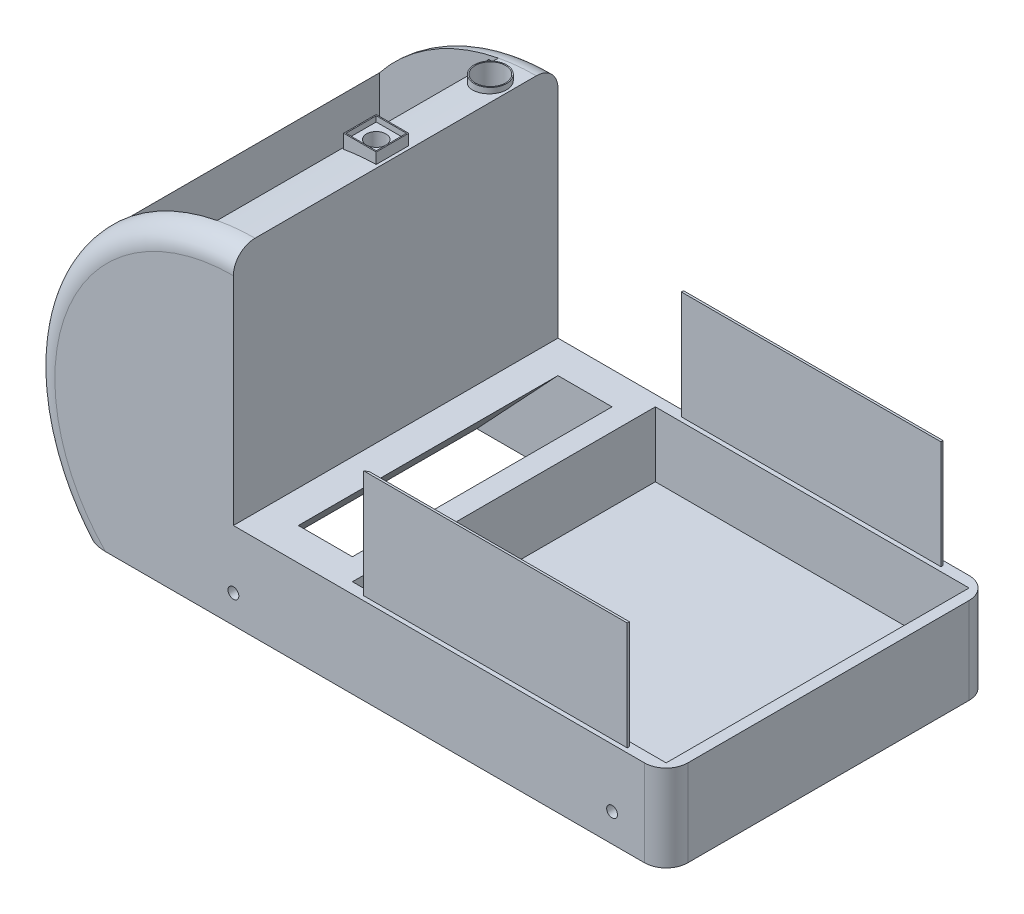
ISO-10303-21;
HEADER;
FILE_DESCRIPTION(('STEP AP214'),'2;1');
FILE_NAME('part.step','',(''),(''),'','','');
FILE_SCHEMA(('AUTOMOTIVE_DESIGN { 1 0 10303 214 1 1 1 1 }'));
ENDSEC;
DATA;
#1=APPLICATION_CONTEXT('core data for automotive mechanical design processes');
#2=APPLICATION_PROTOCOL_DEFINITION('international standard','automotive_design',2000,#1);
#3=PRODUCT_CONTEXT('',#1,'mechanical');
#4=PRODUCT('Part','Part','',(#3));
#5=PRODUCT_RELATED_PRODUCT_CATEGORY('part','',(#4));
#6=PRODUCT_DEFINITION_FORMATION('','',#4);
#7=PRODUCT_DEFINITION_CONTEXT('part definition',#1,'design');
#8=PRODUCT_DEFINITION('design','',#6,#7);
#9=PRODUCT_DEFINITION_SHAPE('','',#8);
#10=(LENGTH_UNIT() NAMED_UNIT(*) SI_UNIT(.MILLI.,.METRE.));
#11=(NAMED_UNIT(*) PLANE_ANGLE_UNIT() SI_UNIT($,.RADIAN.));
#12=(NAMED_UNIT(*) SI_UNIT($,.STERADIAN.) SOLID_ANGLE_UNIT());
#13=UNCERTAINTY_MEASURE_WITH_UNIT(LENGTH_MEASURE(1.E-05),#10,'distance_accuracy_value','');
#14=(GEOMETRIC_REPRESENTATION_CONTEXT(3) GLOBAL_UNCERTAINTY_ASSIGNED_CONTEXT((#13)) GLOBAL_UNIT_ASSIGNED_CONTEXT((#10,
#11,#12)) REPRESENTATION_CONTEXT('',''));
#15=CARTESIAN_POINT('',(0.,0.,0.));
#16=DIRECTION('',(0.,0.,1.));
#17=DIRECTION('',(1.,0.,0.));
#18=AXIS2_PLACEMENT_3D('',#15,#16,#17);
#19=CARTESIAN_POINT('',(100.,115.,300.));
#20=DIRECTION('',(0.,0.,-1.));
#21=DIRECTION('',(-1.,0.,0.));
#22=AXIS2_PLACEMENT_3D('',#19,#20,#21);
#23=CYLINDRICAL_SURFACE('',#22,185.);
#24=DIRECTION('',(0.,0.,-1.));
#25=VECTOR('',#24,1.);
#26=CARTESIAN_POINT('',(64.9999999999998,296.659021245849,300.));
#27=LINE('',#26,#25);
#28=CARTESIAN_POINT('',(64.9999999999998,296.659021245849,280.));
#29=VERTEX_POINT('',#28);
#30=CARTESIAN_POINT('',(64.9999999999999,296.659021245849,20.));
#31=VERTEX_POINT('',#30);
#32=EDGE_CURVE('E838',#29,#31,#27,.T.);
#33=ORIENTED_EDGE('',*,*,#32,.F.);
#34=CARTESIAN_POINT('',(100.,115.,280.));
#35=DIRECTION('',(0.,0.,1.));
#36=DIRECTION('',(1.,0.,0.));
#37=AXIS2_PLACEMENT_3D('',#34,#35,#36);
#38=CIRCLE('',#37,185.);
#39=CARTESIAN_POINT('',(99.9999999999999,300.,280.));
#40=VERTEX_POINT('',#39);
#41=EDGE_CURVE('E1040',#29,#40,#38,.F.);
#42=ORIENTED_EDGE('',*,*,#41,.T.);
#43=DIRECTION('',(0.,0.,-1.));
#44=VECTOR('',#43,1.);
#45=CARTESIAN_POINT('',(99.9999999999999,300.,300.));
#46=LINE('',#45,#44);
#47=CARTESIAN_POINT('',(99.9999999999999,300.,20.));
#48=VERTEX_POINT('',#47);
#49=EDGE_CURVE('E794',#40,#48,#46,.T.);
#50=ORIENTED_EDGE('',*,*,#49,.T.);
#51=CARTESIAN_POINT('',(100.,115.,20.));
#52=DIRECTION('',(0.,0.,1.));
#53=DIRECTION('',(1.,0.,0.));
#54=AXIS2_PLACEMENT_3D('',#51,#52,#53);
#55=CIRCLE('',#54,185.);
#56=EDGE_CURVE('E1038',#48,#31,#55,.T.);
#57=ORIENTED_EDGE('',*,*,#56,.T.);
#58=EDGE_LOOP('',(#33,#42,#50,#57));
#59=FACE_BOUND('',#58,.T.);
#60=DIRECTION('',(0.,0.,-1.));
#61=VECTOR('',#60,1.);
#62=CARTESIAN_POINT('',(66.9999999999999,297.032964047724,300.));
#63=LINE('',#62,#61);
#64=CARTESIAN_POINT('',(66.9999999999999,297.032964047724,135.));
#65=VERTEX_POINT('',#64);
#66=CARTESIAN_POINT('',(66.9999999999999,297.032964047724,165.));
#67=VERTEX_POINT('',#66);
#68=EDGE_CURVE('E64',#65,#67,#63,.F.);
#69=ORIENTED_EDGE('',*,*,#68,.F.);
#70=CARTESIAN_POINT('',(100.,115.,135.));
#71=DIRECTION('',(0.,0.,1.));
#72=DIRECTION('',(0.,-1.,0.));
#73=AXIS2_PLACEMENT_3D('',#70,#71,#72);
#74=CIRCLE('',#73,185.);
#75=CARTESIAN_POINT('',(96.9999999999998,299.97567407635,135.));
#76=VERTEX_POINT('',#75);
#77=EDGE_CURVE('E1055',#76,#65,#74,.T.);
#78=ORIENTED_EDGE('',*,*,#77,.F.);
#79=DIRECTION('',(0.,0.,-1.));
#80=VECTOR('',#79,1.);
#81=CARTESIAN_POINT('',(96.9999999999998,299.97567407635,300.));
#82=LINE('',#81,#80);
#83=CARTESIAN_POINT('',(96.9999999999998,299.97567407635,165.));
#84=VERTEX_POINT('',#83);
#85=EDGE_CURVE('E1059',#84,#76,#82,.T.);
#86=ORIENTED_EDGE('',*,*,#85,.F.);
#87=CARTESIAN_POINT('',(100.,115.,165.));
#88=DIRECTION('',(0.,0.,-1.));
#89=DIRECTION('',(0.,1.,0.));
#90=AXIS2_PLACEMENT_3D('',#87,#88,#89);
#91=CIRCLE('',#90,185.);
#92=EDGE_CURVE('E79',#67,#84,#91,.T.);
#93=ORIENTED_EDGE('',*,*,#92,.F.);
#94=EDGE_LOOP('',(#69,#78,#86,#93));
#95=FACE_BOUND('',#94,.T.);
#96=CARTESIAN_POINT('',(97.4999999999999,299.983107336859,45.));
#97=CARTESIAN_POINT('',(97.5000036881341,299.983106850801,44.5786479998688));
#98=CARTESIAN_POINT('',(97.4822395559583,299.982869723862,44.1573544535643));
#99=CARTESIAN_POINT('',(97.411309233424,299.98189097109,43.317622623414));
#100=CARTESIAN_POINT('',(97.3581342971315,299.98114922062,42.8991850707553));
#101=CARTESIAN_POINT('',(97.2166752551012,299.979074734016,42.0678595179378));
#102=CARTESIAN_POINT('',(97.128355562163,299.97774139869,41.6549775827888));
#103=CARTESIAN_POINT('',(96.917238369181,299.974343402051,40.8381273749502));
#104=CARTESIAN_POINT('',(96.7944410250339,299.972278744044,40.4341590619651));
#105=CARTESIAN_POINT('',(96.5153046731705,299.967230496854,39.638187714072));
#106=CARTESIAN_POINT('',(96.3589804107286,299.964247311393,39.246179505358));
#107=CARTESIAN_POINT('',(96.0138701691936,299.957131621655,38.4767259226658));
#108=CARTESIAN_POINT('',(95.8250837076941,299.952999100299,38.0992807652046));
#109=CARTESIAN_POINT('',(95.4164473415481,299.943323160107,37.3617354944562));
#110=CARTESIAN_POINT('',(95.1966049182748,299.937780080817,37.0016312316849));
#111=CARTESIAN_POINT('',(94.7273942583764,299.924997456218,36.3012353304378));
#112=CARTESIAN_POINT('',(94.4780261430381,299.917757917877,35.9609436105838));
#113=CARTESIAN_POINT('',(93.9516244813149,299.901288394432,35.3026887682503));
#114=CARTESIAN_POINT('',(93.6745989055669,299.892058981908,34.9847192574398));
#115=CARTESIAN_POINT('',(93.0948087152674,299.871313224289,34.3732631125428));
#116=CARTESIAN_POINT('',(92.7920440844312,299.859796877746,34.0797764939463));
#117=CARTESIAN_POINT('',(92.1629434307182,299.834194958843,33.5193647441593));
#118=CARTESIAN_POINT('',(91.8366068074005,299.820109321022,33.2524402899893));
#119=CARTESIAN_POINT('',(91.1627183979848,299.789112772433,32.7470536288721));
#120=CARTESIAN_POINT('',(90.8151666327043,299.772201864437,32.5085913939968));
#121=CARTESIAN_POINT('',(90.1017019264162,299.735354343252,32.0620300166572));
#122=CARTESIAN_POINT('',(89.735807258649,299.715420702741,31.8539014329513));
#123=CARTESIAN_POINT('',(88.9879776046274,299.672346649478,31.4691847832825));
#124=CARTESIAN_POINT('',(88.6060426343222,299.649206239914,31.2925966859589));
#125=CARTESIAN_POINT('',(87.8288817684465,299.599608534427,30.9721819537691));
#126=CARTESIAN_POINT('',(87.4336559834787,299.573151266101,30.8283550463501));
#127=CARTESIAN_POINT('',(86.6327460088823,299.516876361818,30.5744360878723));
#128=CARTESIAN_POINT('',(86.2270618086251,299.487058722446,30.464344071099));
#129=CARTESIAN_POINT('',(85.4078414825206,299.424070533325,30.278553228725));
#130=CARTESIAN_POINT('',(84.9942999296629,299.390897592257,30.2028791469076));
#131=CARTESIAN_POINT('',(84.162594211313,299.321324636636,30.0865127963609));
#132=CARTESIAN_POINT('',(83.7444300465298,299.284924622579,30.0458205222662));
#133=CARTESIAN_POINT('',(82.9064311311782,299.209084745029,29.9996362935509));
#134=CARTESIAN_POINT('',(82.4865963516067,299.169644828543,29.9941449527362));
#135=CARTESIAN_POINT('',(81.6482121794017,299.087993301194,30.0183335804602));
#136=CARTESIAN_POINT('',(81.2296627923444,299.045781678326,30.0480137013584));
#137=CARTESIAN_POINT('',(80.3946541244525,298.958711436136,30.1425118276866));
#138=CARTESIAN_POINT('',(79.9782162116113,298.913840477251,30.20750728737));
#139=CARTESIAN_POINT('',(79.1524970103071,298.82207209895,30.3722365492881));
#140=CARTESIAN_POINT('',(78.743215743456,298.775174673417,30.4719704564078));
#141=CARTESIAN_POINT('',(77.9346329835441,298.679844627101,30.7054377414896));
#142=CARTESIAN_POINT('',(77.5353319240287,298.631411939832,30.8391725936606));
#143=CARTESIAN_POINT('',(76.7494841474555,298.533567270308,31.1396776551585));
#144=CARTESIAN_POINT('',(76.3629374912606,298.484155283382,31.3064480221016));
#145=CARTESIAN_POINT('',(75.6025258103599,298.384599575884,31.67317333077));
#146=CARTESIAN_POINT('',(75.2287723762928,298.334453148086,31.873358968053));
#147=CARTESIAN_POINT('',(74.4995159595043,298.234442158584,32.3046577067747));
#148=CARTESIAN_POINT('',(74.1440130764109,298.18457759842,32.5357709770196));
#149=CARTESIAN_POINT('',(73.453743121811,298.085820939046,33.02733252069));
#150=CARTESIAN_POINT('',(73.1189765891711,298.036928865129,33.2877815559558));
#151=CARTESIAN_POINT('',(72.4725558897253,297.940828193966,33.8362181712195));
#152=CARTESIAN_POINT('',(72.1609017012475,297.893619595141,34.1242057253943));
#153=CARTESIAN_POINT('',(71.5624767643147,297.80152922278,34.7261990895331));
#154=CARTESIAN_POINT('',(71.2757446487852,297.756651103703,35.0402438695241));
#155=CARTESIAN_POINT('',(70.7297825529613,297.670005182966,35.6917977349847));
#156=CARTESIAN_POINT('',(70.4705526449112,297.628237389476,36.029306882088));
#157=CARTESIAN_POINT('',(69.9815234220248,297.548493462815,36.7254204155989));
#158=CARTESIAN_POINT('',(69.7517230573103,297.510517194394,37.0840240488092));
#159=CARTESIAN_POINT('',(69.3232772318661,297.438992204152,37.8198045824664));
#160=CARTESIAN_POINT('',(69.1246314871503,297.405443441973,38.1969813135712));
#161=CARTESIAN_POINT('',(68.7617053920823,297.343638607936,38.9636539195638));
#162=CARTESIAN_POINT('',(68.5971247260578,297.315336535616,39.3530039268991));
#163=CARTESIAN_POINT('',(68.3013099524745,297.264136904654,40.1445189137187));
#164=CARTESIAN_POINT('',(68.1700756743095,297.241239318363,40.5466838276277));
#165=CARTESIAN_POINT('',(67.9419890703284,297.201255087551,41.3609001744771));
#166=CARTESIAN_POINT('',(67.8451342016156,297.184168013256,41.7729508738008));
#167=CARTESIAN_POINT('',(67.6865623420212,297.156109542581,42.6039635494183));
#168=CARTESIAN_POINT('',(67.6248450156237,297.145138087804,43.0229254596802));
#169=CARTESIAN_POINT('',(67.537638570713,297.129615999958,43.8589585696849));
#170=CARTESIAN_POINT('',(67.5116685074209,297.124980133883,44.2759780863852));
#171=CARTESIAN_POINT('',(67.4946005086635,297.121934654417,45.1107506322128));
#172=CARTESIAN_POINT('',(67.503502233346,297.123524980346,45.5285036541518));
#173=CARTESIAN_POINT('',(67.5561064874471,297.132903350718,46.3617265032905));
#174=CARTESIAN_POINT('',(67.5998077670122,297.140691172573,46.7771964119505));
#175=CARTESIAN_POINT('',(67.7216674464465,297.162326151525,47.6028910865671));
#176=CARTESIAN_POINT('',(67.7998258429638,297.176173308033,48.013115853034));
#177=CARTESIAN_POINT('',(67.9895231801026,297.209600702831,48.8233944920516));
#178=CARTESIAN_POINT('',(68.1008957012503,297.229152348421,49.2234885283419));
#179=CARTESIAN_POINT('',(68.3563104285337,297.273678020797,50.0127941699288));
#180=CARTESIAN_POINT('',(68.5003524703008,297.298652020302,50.4020058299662));
#181=CARTESIAN_POINT('',(68.8200333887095,297.353601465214,51.1668731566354));
#182=CARTESIAN_POINT('',(68.9956731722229,297.383577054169,51.5425284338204));
#183=CARTESIAN_POINT('',(69.3772563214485,297.448033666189,52.2777145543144));
#184=CARTESIAN_POINT('',(69.5831999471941,297.482514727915,52.6372452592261));
#185=CARTESIAN_POINT('',(70.0258049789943,297.555740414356,53.3407828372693));
#186=CARTESIAN_POINT('',(70.2627157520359,297.594519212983,53.6846292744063));
#187=CARTESIAN_POINT('',(70.7641481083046,297.675475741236,54.3511336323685));
#188=CARTESIAN_POINT('',(71.0286698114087,297.717653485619,54.6737914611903));
#189=CARTESIAN_POINT('',(71.5834705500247,297.80475836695,55.2957789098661));
#190=CARTESIAN_POINT('',(71.8737511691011,297.849685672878,55.5951070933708));
#191=CARTESIAN_POINT('',(72.4780364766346,297.94161611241,56.1684249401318));
#192=CARTESIAN_POINT('',(72.7920413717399,297.988619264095,56.4424143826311));
#193=CARTESIAN_POINT('',(73.4460289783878,298.084672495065,56.9667724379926));
#194=CARTESIAN_POINT('',(73.7863063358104,298.133741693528,57.216770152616));
#195=CARTESIAN_POINT('',(74.4866426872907,298.23262166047,57.6871605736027));
#196=CARTESIAN_POINT('',(74.8467018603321,298.282432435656,57.9075530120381));
#197=CARTESIAN_POINT('',(75.5841148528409,298.38212280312,58.3172234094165));
#198=CARTESIAN_POINT('',(75.9614692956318,298.432002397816,58.5065002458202));
#199=CARTESIAN_POINT('',(76.7308475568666,298.531188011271,58.8526104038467));
#200=CARTESIAN_POINT('',(77.1228713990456,298.580494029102,59.0094436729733));
#201=CARTESIAN_POINT('',(77.9214383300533,298.678251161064,59.2904545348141));
#202=CARTESIAN_POINT('',(78.328058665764,298.72669472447,59.4144153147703));
#203=CARTESIAN_POINT('',(79.15054459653,298.821847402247,59.6274267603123));
#204=CARTESIAN_POINT('',(79.5664102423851,298.868556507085,59.7164772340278));
#205=CARTESIAN_POINT('',(80.4044338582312,298.959754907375,59.8589786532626));
#206=CARTESIAN_POINT('',(80.8265917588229,299.004244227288,59.9124299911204));
#207=CARTESIAN_POINT('',(81.6741891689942,299.090592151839,59.9832871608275));
#208=CARTESIAN_POINT('',(82.099628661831,299.13245076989,60.000693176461));
#209=CARTESIAN_POINT('',(82.9491103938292,299.213051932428,59.9992672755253));
#210=CARTESIAN_POINT('',(83.3731517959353,299.251805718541,59.9805728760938));
#211=CARTESIAN_POINT('',(84.2184033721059,299.326127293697,59.9072815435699));
#212=CARTESIAN_POINT('',(84.6396135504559,299.361695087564,59.8526846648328));
#213=CARTESIAN_POINT('',(85.4761368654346,299.429481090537,59.7079157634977));
#214=CARTESIAN_POINT('',(85.8914501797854,299.461699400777,59.6177448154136));
#215=CARTESIAN_POINT('',(86.713163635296,299.522707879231,59.402417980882));
#216=CARTESIAN_POINT('',(87.1195638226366,299.55149806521,59.2772622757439));
#217=CARTESIAN_POINT('',(87.9175759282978,299.605454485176,58.9938508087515));
#218=CARTESIAN_POINT('',(88.3092735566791,299.630645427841,58.8358410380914));
#219=CARTESIAN_POINT('',(89.078114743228,299.677721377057,58.487273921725));
#220=CARTESIAN_POINT('',(89.4552583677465,299.699606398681,58.2967167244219));
#221=CARTESIAN_POINT('',(90.1922375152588,299.74020680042,57.8843998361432));
#222=CARTESIAN_POINT('',(90.5520739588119,299.758922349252,57.6626418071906));
#223=CARTESIAN_POINT('',(91.2518501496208,299.793378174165,57.1894835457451));
#224=CARTESIAN_POINT('',(91.5917899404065,299.809118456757,56.9380833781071));
#225=CARTESIAN_POINT('',(92.2480292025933,299.837805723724,56.4084627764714));
#226=CARTESIAN_POINT('',(92.5644155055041,299.850763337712,56.1303504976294));
#227=CARTESIAN_POINT('',(93.1727307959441,299.874230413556,55.5484585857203));
#228=CARTESIAN_POINT('',(93.464659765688,299.884739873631,55.2446789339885));
#229=CARTESIAN_POINT('',(94.0220341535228,299.903601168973,54.6135333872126));
#230=CARTESIAN_POINT('',(94.2874732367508,299.911952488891,54.2861618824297));
#231=CARTESIAN_POINT('',(94.7898861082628,299.926790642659,53.6102278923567));
#232=CARTESIAN_POINT('',(95.0268602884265,299.933277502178,53.261665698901));
#233=CARTESIAN_POINT('',(95.4707752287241,299.944682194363,52.5456295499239));
#234=CARTESIAN_POINT('',(95.6776997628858,299.949599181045,52.1781455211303));
#235=CARTESIAN_POINT('',(96.0598877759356,299.958135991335,51.4270524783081));
#236=CARTESIAN_POINT('',(96.2351510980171,299.961755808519,51.0434433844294));
#237=CARTESIAN_POINT('',(96.5526077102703,299.967945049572,50.2632122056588));
#238=CARTESIAN_POINT('',(96.6948341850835,299.970515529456,49.8666036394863));
#239=CARTESIAN_POINT('',(96.9453987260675,299.974822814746,49.0629573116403));
#240=CARTESIAN_POINT('',(97.0537451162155,299.976559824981,48.6559221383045));
#241=CARTESIAN_POINT('',(97.2627077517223,299.979786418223,47.7128254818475));
#242=CARTESIAN_POINT('',(97.351612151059,299.981051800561,47.1741275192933));
#243=CARTESIAN_POINT('',(97.4702559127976,299.982712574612,46.09025376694));
#244=CARTESIAN_POINT('',(97.4999952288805,299.983107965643,45.5450779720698));
#245=CARTESIAN_POINT('',(97.4999999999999,299.983107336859,45.));
#246=B_SPLINE_CURVE_WITH_KNOTS('',3,(#96,#97,#98,#99,#100,#101,#102,#103,#104,#105,#106,#107,
#108,#109,#110,#111,#112,#113,#114,#115,#116,#117,#118,#119,#120,#121,#122,#123,#124,#125,#126,
#127,#128,#129,#130,#131,#132,#133,#134,#135,#136,#137,#138,#139,#140,#141,#142,#143,#144,#145,
#146,#147,#148,#149,#150,#151,#152,#153,#154,#155,#156,#157,#158,#159,#160,#161,#162,#163,#164,
#165,#166,#167,#168,#169,#170,#171,#172,#173,#174,#175,#176,#177,#178,#179,#180,#181,#182,#183,
#184,#185,#186,#187,#188,#189,#190,#191,#192,#193,#194,#195,#196,#197,#198,#199,#200,#201,#202,
#203,#204,#205,#206,#207,#208,#209,#210,#211,#212,#213,#214,#215,#216,#217,#218,#219,#220,#221,
#222,#223,#224,#225,#226,#227,#228,#229,#230,#231,#232,#233,#234,#235,#236,#237,#238,#239,#240,
#241,#242,#243,#244,#245),.UNSPECIFIED.,.T.,.F.,(4,2,2,2,2,2,2,2,2,2,2,2,2,2,2,2,2,2,2,2,2,2,2,
2,2,2,2,2,2,2,2,2,2,2,2,2,2,2,2,2,2,2,2,2,2,2,2,2,2,2,2,2,2,2,2,2,2,2,2,2,2,2,2,2,2,2,2,2,2,2,2,
2,2,2,4),(0.,1.263581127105,2.52747445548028,3.79265085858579,5.05782154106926,6.32243693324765,
7.58707111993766,8.85140117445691,10.1157260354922,11.3796875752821,12.6436499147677,
13.9076444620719,15.1716377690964,16.4343959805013,17.6971529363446,18.9598993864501,
20.2226471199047,21.4863012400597,22.7499551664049,24.0136311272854,25.2773125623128,
26.5474033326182,27.8174979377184,29.0876476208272,30.3578033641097,31.6371212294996,
32.9164460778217,34.1958041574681,35.4751610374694,36.756466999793,38.0377763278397,
39.3190399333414,40.6002918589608,41.8697158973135,43.1391334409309,44.4084570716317,
45.6777685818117,46.9298300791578,48.1818793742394,49.4338837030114,50.6858879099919,
51.9317214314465,53.1775486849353,54.4234117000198,55.6692854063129,56.9258931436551,
58.1825063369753,59.4391968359,60.6958982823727,61.9696495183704,63.2434122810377,
64.5172209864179,65.7910317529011,67.0730460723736,68.3550674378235,69.6370746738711,
70.919075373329,72.1962021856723,73.473327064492,74.7504133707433,76.0274930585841,
77.2953345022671,78.5631701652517,79.8309383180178,81.0987036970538,82.361536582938,
83.6243703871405,84.8875054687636,86.1506231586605,87.4144203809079,88.6782238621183,
89.9407523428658,91.2029703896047,92.8375887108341,94.47220831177),.UNSPECIFIED.);
#247=CARTESIAN_POINT('',(97.4999999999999,299.983107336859,45.));
#248=VERTEX_POINT('',#247);
#249=EDGE_CURVE('E12',#248,#248,#246,.T.);
#250=ORIENTED_EDGE('',*,*,#249,.F.);
#251=EDGE_LOOP('',(#250));
#252=FACE_BOUND('',#251,.T.);
#253=ADVANCED_FACE('F49',(#59,#95,#252),#23,.T.);
#254=DIRECTION('',(0.,0.,-1.));
#255=VECTOR('',#254,1.);
#256=CARTESIAN_POINT('',(-44.9137674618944,0.,300.));
#257=LINE('',#256,#255);
#258=CARTESIAN_POINT('',(-44.9137674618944,0.,280.));
#259=VERTEX_POINT('',#258);
#260=CARTESIAN_POINT('',(-44.9137674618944,0.,20.));
#261=VERTEX_POINT('',#260);
#262=EDGE_CURVE('E782',#259,#261,#257,.T.);
#263=ORIENTED_EDGE('',*,*,#262,.F.);
#264=CARTESIAN_POINT('',(100.,115.,280.));
#265=DIRECTION('',(0.,0.,1.));
#266=DIRECTION('',(1.,0.,0.));
#267=AXIS2_PLACEMENT_3D('',#264,#265,#266);
#268=CIRCLE('',#267,185.);
#269=CARTESIAN_POINT('',(-45.0000000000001,229.89125293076,280.));
#270=VERTEX_POINT('',#269);
#271=EDGE_CURVE('E1030',#259,#270,#268,.F.);
#272=ORIENTED_EDGE('',*,*,#271,.T.);
#273=DIRECTION('',(0.,0.,-1.));
#274=VECTOR('',#273,1.);
#275=CARTESIAN_POINT('',(-45.0000000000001,229.89125293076,300.));
#276=LINE('',#275,#274);
#277=CARTESIAN_POINT('',(-45.0000000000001,229.89125293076,20.));
#278=VERTEX_POINT('',#277);
#279=EDGE_CURVE('E990',#278,#270,#276,.F.);
#280=ORIENTED_EDGE('',*,*,#279,.F.);
#281=CARTESIAN_POINT('',(100.,115.,20.));
#282=DIRECTION('',(0.,0.,1.));
#283=DIRECTION('',(1.,0.,0.));
#284=AXIS2_PLACEMENT_3D('',#281,#282,#283);
#285=CIRCLE('',#284,185.);
#286=EDGE_CURVE('E891',#278,#261,#285,.T.);
#287=ORIENTED_EDGE('',*,*,#286,.T.);
#288=EDGE_LOOP('',(#263,#272,#280,#287));
#289=FACE_BOUND('',#288,.T.);
#290=ADVANCED_FACE('F913',(#289),#23,.T.);
#291=CARTESIAN_POINT('',(500.,80.,300.));
#292=DIRECTION('',(0.,-1.,0.));
#293=DIRECTION('',(1.,0.,0.));
#294=AXIS2_PLACEMENT_3D('',#291,#292,#293);
#295=PLANE('',#294);
#296=DIRECTION('',(0.,0.,-1.));
#297=VECTOR('',#296,1.);
#298=CARTESIAN_POINT('',(460.,80.,6.00000000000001));
#299=LINE('',#298,#297);
#300=CARTESIAN_POINT('',(460.,80.,6.00000000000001));
#301=VERTEX_POINT('',#300);
#302=CARTESIAN_POINT('',(460.,80.,4.00000000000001));
#303=VERTEX_POINT('',#302);
#304=EDGE_CURVE('E636',#301,#303,#299,.T.);
#305=ORIENTED_EDGE('',*,*,#304,.F.);
#306=DIRECTION('',(1.,0.,0.));
#307=VECTOR('',#306,1.);
#308=CARTESIAN_POINT('',(460.,80.,6.00000000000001));
#309=LINE('',#308,#307);
#310=CARTESIAN_POINT('',(220.,80.,6.00000000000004));
#311=VERTEX_POINT('',#310);
#312=EDGE_CURVE('E642',#311,#301,#309,.T.);
#313=ORIENTED_EDGE('',*,*,#312,.F.);
#314=DIRECTION('',(0.,0.,1.));
#315=VECTOR('',#314,1.);
#316=CARTESIAN_POINT('',(220.,80.,6.00000000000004));
#317=LINE('',#316,#315);
#318=CARTESIAN_POINT('',(220.,80.,4.));
#319=VERTEX_POINT('',#318);
#320=EDGE_CURVE('E659',#319,#311,#317,.T.);
#321=ORIENTED_EDGE('',*,*,#320,.F.);
#322=DIRECTION('',(-1.,0.,0.));
#323=VECTOR('',#322,1.);
#324=CARTESIAN_POINT('',(460.,80.,4.00000000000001));
#325=LINE('',#324,#323);
#326=EDGE_CURVE('E655',#303,#319,#325,.T.);
#327=ORIENTED_EDGE('',*,*,#326,.F.);
#328=EDGE_LOOP('',(#305,#313,#321,#327));
#329=FACE_BOUND('',#328,.T.);
#330=DIRECTION('',(0.,0.,-1.));
#331=VECTOR('',#330,1.);
#332=CARTESIAN_POINT('',(500.,80.,300.));
#333=LINE('',#332,#331);
#334=CARTESIAN_POINT('',(500.,80.,280.));
#335=VERTEX_POINT('',#334);
#336=CARTESIAN_POINT('',(500.,80.,20.));
#337=VERTEX_POINT('',#336);
#338=EDGE_CURVE('E802',#335,#337,#333,.T.);
#339=ORIENTED_EDGE('',*,*,#338,.T.);
#340=CARTESIAN_POINT('',(480.,80.,20.));
#341=DIRECTION('',(0.,-1.,0.));
#342=DIRECTION('',(1.,0.,0.));
#343=AXIS2_PLACEMENT_3D('',#340,#341,#342);
#344=CIRCLE('',#343,20.);
#345=CARTESIAN_POINT('',(480.,80.,0.));
#346=VERTEX_POINT('',#345);
#347=EDGE_CURVE('E820',#337,#346,#344,.F.);
#348=ORIENTED_EDGE('',*,*,#347,.T.);
#349=DIRECTION('',(-1.,0.,0.));
#350=VECTOR('',#349,1.);
#351=CARTESIAN_POINT('',(500.,80.,0.));
#352=LINE('',#351,#350);
#353=CARTESIAN_POINT('',(100.,80.,0.));
#354=VERTEX_POINT('',#353);
#355=EDGE_CURVE('E785',#346,#354,#352,.T.);
#356=ORIENTED_EDGE('',*,*,#355,.T.);
#357=DIRECTION('',(0.,0.,-1.));
#358=VECTOR('',#357,1.);
#359=CARTESIAN_POINT('',(100.,80.,300.));
#360=LINE('',#359,#358);
#361=CARTESIAN_POINT('',(100.,80.,300.));
#362=VERTEX_POINT('',#361);
#363=EDGE_CURVE('E798',#362,#354,#360,.T.);
#364=ORIENTED_EDGE('',*,*,#363,.F.);
#365=DIRECTION('',(-1.,0.,0.));
#366=VECTOR('',#365,1.);
#367=CARTESIAN_POINT('',(500.,80.,300.));
#368=LINE('',#367,#366);
#369=CARTESIAN_POINT('',(480.,80.,300.));
#370=VERTEX_POINT('',#369);
#371=EDGE_CURVE('E774',#370,#362,#368,.T.);
#372=ORIENTED_EDGE('',*,*,#371,.F.);
#373=CARTESIAN_POINT('',(480.,80.,280.));
#374=DIRECTION('',(0.,-1.,0.));
#375=DIRECTION('',(1.,0.,0.));
#376=AXIS2_PLACEMENT_3D('',#373,#374,#375);
#377=CIRCLE('',#376,20.);
#378=EDGE_CURVE('E817',#370,#335,#377,.F.);
#379=ORIENTED_EDGE('',*,*,#378,.T.);
#380=EDGE_LOOP('',(#339,#348,#356,#364,#372,#379));
#381=FACE_BOUND('',#380,.T.);
#382=DIRECTION('',(1.,0.,0.));
#383=VECTOR('',#382,1.);
#384=CARTESIAN_POINT('',(490.,80.,290.));
#385=LINE('',#384,#383);
#386=CARTESIAN_POINT('',(200.,80.,290.));
#387=VERTEX_POINT('',#386);
#388=CARTESIAN_POINT('',(490.,80.,290.));
#389=VERTEX_POINT('',#388);
#390=EDGE_CURVE('E747',#387,#389,#385,.T.);
#391=ORIENTED_EDGE('',*,*,#390,.F.);
#392=DIRECTION('',(0.,0.,1.));
#393=VECTOR('',#392,1.);
#394=CARTESIAN_POINT('',(200.,80.,290.));
#395=LINE('',#394,#393);
#396=CARTESIAN_POINT('',(200.,80.,10.));
#397=VERTEX_POINT('',#396);
#398=EDGE_CURVE('E726',#397,#387,#395,.T.);
#399=ORIENTED_EDGE('',*,*,#398,.F.);
#400=DIRECTION('',(-1.,0.,0.));
#401=VECTOR('',#400,1.);
#402=CARTESIAN_POINT('',(490.,80.,10.));
#403=LINE('',#402,#401);
#404=CARTESIAN_POINT('',(490.,80.,10.));
#405=VERTEX_POINT('',#404);
#406=EDGE_CURVE('E732',#405,#397,#403,.T.);
#407=ORIENTED_EDGE('',*,*,#406,.F.);
#408=DIRECTION('',(0.,0.,-1.));
#409=VECTOR('',#408,1.);
#410=CARTESIAN_POINT('',(490.,80.,290.));
#411=LINE('',#410,#409);
#412=EDGE_CURVE('E751',#389,#405,#411,.T.);
#413=ORIENTED_EDGE('',*,*,#412,.F.);
#414=EDGE_LOOP('',(#391,#399,#407,#413));
#415=FACE_BOUND('',#414,.T.);
#416=DIRECTION('',(0.,0.,-1.));
#417=VECTOR('',#416,1.);
#418=CARTESIAN_POINT('',(460.,80.,296.));
#419=LINE('',#418,#417);
#420=CARTESIAN_POINT('',(460.,80.,296.));
#421=VERTEX_POINT('',#420);
#422=CARTESIAN_POINT('',(460.,80.,294.));
#423=VERTEX_POINT('',#422);
#424=EDGE_CURVE('E681',#421,#423,#419,.T.);
#425=ORIENTED_EDGE('',*,*,#424,.F.);
#426=DIRECTION('',(1.,0.,0.));
#427=VECTOR('',#426,1.);
#428=CARTESIAN_POINT('',(216.358872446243,80.,296.));
#429=LINE('',#428,#427);
#430=CARTESIAN_POINT('',(216.358872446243,80.,296.));
#431=VERTEX_POINT('',#430);
#432=EDGE_CURVE('E687',#431,#421,#429,.T.);
#433=ORIENTED_EDGE('',*,*,#432,.F.);
#434=DIRECTION('',(-0.876482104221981,0.,0.481434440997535));
#435=VECTOR('',#434,1.);
#436=CARTESIAN_POINT('',(220.,80.,294.));
#437=LINE('',#436,#435);
#438=CARTESIAN_POINT('',(220.,80.,294.));
#439=VERTEX_POINT('',#438);
#440=EDGE_CURVE('E704',#439,#431,#437,.T.);
#441=ORIENTED_EDGE('',*,*,#440,.F.);
#442=DIRECTION('',(-1.,0.,0.));
#443=VECTOR('',#442,1.);
#444=CARTESIAN_POINT('',(460.,80.,294.));
#445=LINE('',#444,#443);
#446=EDGE_CURVE('E700',#423,#439,#445,.T.);
#447=ORIENTED_EDGE('',*,*,#446,.F.);
#448=EDGE_LOOP('',(#425,#433,#441,#447));
#449=FACE_BOUND('',#448,.T.);
#450=DIRECTION('',(1.,0.,0.));
#451=VECTOR('',#450,1.);
#452=CARTESIAN_POINT('',(180.,80.,270.));
#453=LINE('',#452,#451);
#454=CARTESIAN_POINT('',(130.,80.,270.));
#455=VERTEX_POINT('',#454);
#456=CARTESIAN_POINT('',(180.,80.,270.));
#457=VERTEX_POINT('',#456);
#458=EDGE_CURVE('E610',#455,#457,#453,.T.);
#459=ORIENTED_EDGE('',*,*,#458,.F.);
#460=DIRECTION('',(0.,0.,1.));
#461=VECTOR('',#460,1.);
#462=CARTESIAN_POINT('',(130.,80.,30.));
#463=LINE('',#462,#461);
#464=CARTESIAN_POINT('',(130.,80.,30.));
#465=VERTEX_POINT('',#464);
#466=EDGE_CURVE('E605',#465,#455,#463,.T.);
#467=ORIENTED_EDGE('',*,*,#466,.F.);
#468=DIRECTION('',(-1.,0.,0.));
#469=VECTOR('',#468,1.);
#470=CARTESIAN_POINT('',(180.,80.,30.));
#471=LINE('',#470,#469);
#472=CARTESIAN_POINT('',(180.,80.,30.));
#473=VERTEX_POINT('',#472);
#474=EDGE_CURVE('E598',#473,#465,#471,.T.);
#475=ORIENTED_EDGE('',*,*,#474,.F.);
#476=DIRECTION('',(0.,0.,-1.));
#477=VECTOR('',#476,1.);
#478=CARTESIAN_POINT('',(180.,80.,30.));
#479=LINE('',#478,#477);
#480=EDGE_CURVE('E602',#457,#473,#479,.T.);
#481=ORIENTED_EDGE('',*,*,#480,.F.);
#482=EDGE_LOOP('',(#459,#467,#475,#481));
#483=FACE_BOUND('',#482,.T.);
#484=ADVANCED_FACE('F862',(#329,#381,#415,#449,#483),#295,.F.);
#485=CARTESIAN_POINT('',(500.,0.,300.));
#486=DIRECTION('',(0.,1.,0.));
#487=DIRECTION('',(-1.,0.,0.));
#488=AXIS2_PLACEMENT_3D('',#485,#486,#487);
#489=PLANE('',#488);
#490=CARTESIAN_POINT('',(-4.91376746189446,0.,50.));
#491=DIRECTION('',(0.,-1.,0.));
#492=DIRECTION('',(1.,0.,0.));
#493=AXIS2_PLACEMENT_3D('',#490,#491,#492);
#494=CIRCLE('',#493,15.);
#495=CARTESIAN_POINT('',(10.0862325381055,0.,50.));
#496=VERTEX_POINT('',#495);
#497=EDGE_CURVE('E475',#496,#496,#494,.T.);
#498=ORIENTED_EDGE('',*,*,#497,.F.);
#499=EDGE_LOOP('',(#498));
#500=FACE_BOUND('',#499,.T.);
#501=CARTESIAN_POINT('',(-4.91376746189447,0.,250.));
#502=DIRECTION('',(0.,-1.,0.));
#503=DIRECTION('',(1.,0.,0.));
#504=AXIS2_PLACEMENT_3D('',#501,#502,#503);
#505=CIRCLE('',#504,15.);
#506=CARTESIAN_POINT('',(10.0862325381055,0.,250.));
#507=VERTEX_POINT('',#506);
#508=EDGE_CURVE('E471',#507,#507,#505,.T.);
#509=ORIENTED_EDGE('',*,*,#508,.F.);
#510=EDGE_LOOP('',(#509));
#511=FACE_BOUND('',#510,.T.);
#512=DIRECTION('',(1.,0.,0.));
#513=VECTOR('',#512,1.);
#514=CARTESIAN_POINT('',(500.,0.,300.));
#515=LINE('',#514,#513);
#516=CARTESIAN_POINT('',(-18.3215956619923,0.,300.));
#517=VERTEX_POINT('',#516);
#518=CARTESIAN_POINT('',(480.,0.,300.));
#519=VERTEX_POINT('',#518);
#520=EDGE_CURVE('E771',#517,#519,#515,.T.);
#521=ORIENTED_EDGE('',*,*,#520,.F.);
#522=CARTESIAN_POINT('',(-18.3215956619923,0.,300.));
#523=CARTESIAN_POINT('',(-18.7417072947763,0.,299.999994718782));
#524=CARTESIAN_POINT('',(-19.1617922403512,0.,299.993192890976));
#525=CARTESIAN_POINT('',(-20.0015358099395,0.,299.96575146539));
#526=CARTESIAN_POINT('',(-20.4211944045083,0.,299.945110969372));
#527=CARTESIAN_POINT('',(-21.6794647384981,0.,299.862027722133));
#528=CARTESIAN_POINT('',(-22.5167932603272,0.,299.778422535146));
#529=CARTESIAN_POINT('',(-24.1902575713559,0.,299.551714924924));
#530=CARTESIAN_POINT('',(-25.0263288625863,0.,299.408136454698));
#531=CARTESIAN_POINT('',(-26.685283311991,0.,299.058955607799));
#532=CARTESIAN_POINT('',(-27.5081705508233,0.,298.853372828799));
#533=CARTESIAN_POINT('',(-29.0375472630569,0.,298.406007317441));
#534=CARTESIAN_POINT('',(-29.7461685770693,0.,298.17151451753));
#535=CARTESIAN_POINT('',(-31.1441739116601,0.,297.650471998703));
#536=CARTESIAN_POINT('',(-31.8335567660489,0.,297.363919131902));
#537=CARTESIAN_POINT('',(-33.1857045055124,0.,296.737810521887));
#538=CARTESIAN_POINT('',(-33.8485348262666,0.,296.398396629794));
#539=CARTESIAN_POINT('',(-35.1429910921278,0.,295.664530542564));
#540=CARTESIAN_POINT('',(-35.7746248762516,0.,295.270092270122));
#541=CARTESIAN_POINT('',(-36.8695499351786,0.,294.514662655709));
#542=CARTESIAN_POINT('',(-37.3401679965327,0.,294.164272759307));
#543=CARTESIAN_POINT('',(-38.253270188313,0.,293.428513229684));
#544=CARTESIAN_POINT('',(-38.6957558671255,0.,293.043145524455));
#545=CARTESIAN_POINT('',(-39.5478896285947,0.,292.237806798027));
#546=CARTESIAN_POINT('',(-39.9575519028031,0.,291.817850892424));
#547=CARTESIAN_POINT('',(-40.5436458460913,0.,291.162766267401));
#548=CARTESIAN_POINT('',(-40.7342726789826,0.,290.940219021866));
#549=CARTESIAN_POINT('',(-41.1055144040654,0.,290.486819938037));
#550=CARTESIAN_POINT('',(-41.2861266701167,0.,290.255965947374));
#551=CARTESIAN_POINT('',(-41.754133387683,0.,289.62873382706));
#552=CARTESIAN_POINT('',(-42.0319495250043,0.,289.225133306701));
#553=CARTESIAN_POINT('',(-42.5544195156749,0.,288.397102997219));
#554=CARTESIAN_POINT('',(-42.7990794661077,0.,287.972677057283));
#555=CARTESIAN_POINT('',(-43.2519162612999,0.,287.105487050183));
#556=CARTESIAN_POINT('',(-43.4601433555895,0.,286.662749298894));
#557=CARTESIAN_POINT('',(-43.8375976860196,0.,285.760946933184));
#558=CARTESIAN_POINT('',(-44.0068297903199,0.,285.301884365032));
#559=CARTESIAN_POINT('',(-44.2794553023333,0.,284.446711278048));
#560=CARTESIAN_POINT('',(-44.3890896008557,0.,284.052581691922));
#561=CARTESIAN_POINT('',(-44.5780470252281,0.,283.257173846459));
#562=CARTESIAN_POINT('',(-44.6573752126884,0.,282.855896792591));
#563=CARTESIAN_POINT('',(-44.7850343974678,0.,282.046844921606));
#564=CARTESIAN_POINT('',(-44.833247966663,0.,281.639051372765));
#565=CARTESIAN_POINT('',(-44.8815262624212,0.,281.025476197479));
#566=CARTESIAN_POINT('',(-44.8936120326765,0.,280.820577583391));
#567=CARTESIAN_POINT('',(-44.9097335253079,0.,280.410459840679));
#568=CARTESIAN_POINT('',(-44.9137690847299,0.,280.205240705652));
#569=CARTESIAN_POINT('',(-44.9137674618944,0.,280.));
#570=B_SPLINE_CURVE_WITH_KNOTS('',3,(#522,#523,#524,#525,#526,#527,#528,#529,#530,#531,#532,
#533,#534,#535,#536,#537,#538,#539,#540,#541,#542,#543,#544,#545,#546,#547,#548,#549,#550,#551,
#552,#553,#554,#555,#556,#557,#558,#559,#560,#561,#562,#563,#564,#565,#566,#567,#568,#569),
.UNSPECIFIED.,.F.,.F.,(4,2,2,2,2,2,2,2,2,2,2,2,2,2,2,2,2,2,2,2,2,2,2,4),(0.,1.26022192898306,
2.52052566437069,5.04286298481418,7.58561408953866,10.1275623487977,12.3649065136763,
14.6023860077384,16.8339615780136,19.0649735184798,20.8236023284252,22.5821342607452,
24.3399017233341,25.2187399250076,26.0978075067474,27.5661462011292,29.0342145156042,
30.5002417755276,31.9660859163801,33.1922339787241,34.418177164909,35.6487204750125,
36.264347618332,36.879987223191),.UNSPECIFIED.);
#571=EDGE_CURVE('E882',#517,#259,#570,.T.);
#572=ORIENTED_EDGE('',*,*,#571,.T.);
#573=ORIENTED_EDGE('',*,*,#262,.T.);
#574=CARTESIAN_POINT('',(-44.9137674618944,0.,20.));
#575=CARTESIAN_POINT('',(-44.9137702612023,0.,19.7631680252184));
#576=CARTESIAN_POINT('',(-44.9083957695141,0.,19.5263694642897));
#577=CARTESIAN_POINT('',(-44.8869346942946,0.,19.0532692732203));
#578=CARTESIAN_POINT('',(-44.8708486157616,0.,18.8169676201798));
#579=CARTESIAN_POINT('',(-44.8066165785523,0.,18.1097566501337));
#580=CARTESIAN_POINT('',(-44.7424966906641,0.,17.6402016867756));
#581=CARTESIAN_POINT('',(-44.5731936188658,0.,16.7114920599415));
#582=CARTESIAN_POINT('',(-44.468253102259,0.,16.2522925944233));
#583=CARTESIAN_POINT('',(-44.2189146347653,0.,15.3447074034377));
#584=CARTESIAN_POINT('',(-44.0745138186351,0.,14.8963224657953));
#585=CARTESIAN_POINT('',(-43.7486503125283,0.,14.0141461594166));
#586=CARTESIAN_POINT('',(-43.5672516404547,0.,13.5803310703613));
#587=CARTESIAN_POINT('',(-43.1696701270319,0.,12.7289321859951));
#588=CARTESIAN_POINT('',(-42.9534837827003,0.,12.3113500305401));
#589=CARTESIAN_POINT('',(-42.4887474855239,0.,11.4940302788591));
#590=CARTESIAN_POINT('',(-42.2401618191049,0.,11.094313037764));
#591=CARTESIAN_POINT('',(-41.7135832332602,0.,10.3147748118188));
#592=CARTESIAN_POINT('',(-41.4355891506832,0.,9.9349546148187));
#593=CARTESIAN_POINT('',(-40.8333851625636,0.,9.17153987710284));
#594=CARTESIAN_POINT('',(-40.5073250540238,0.,8.78940624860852));
#595=CARTESIAN_POINT('',(-39.8281558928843,0.,8.05005082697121));
#596=CARTESIAN_POINT('',(-39.475046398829,0.,7.69282944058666));
#597=CARTESIAN_POINT('',(-38.7449314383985,0.,7.0038676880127));
#598=CARTESIAN_POINT('',(-38.3679296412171,0.,6.67212342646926));
#599=CARTESIAN_POINT('',(-37.5928334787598,0.,6.03421726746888));
#600=CARTESIAN_POINT('',(-37.1947349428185,0.,5.7280604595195));
#601=CARTESIAN_POINT('',(-36.1751161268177,0.,4.99366824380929));
#602=CARTESIAN_POINT('',(-35.5419531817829,0.,4.58150448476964));
#603=CARTESIAN_POINT('',(-34.2419959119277,0.,3.81402899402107));
#604=CARTESIAN_POINT('',(-33.5751883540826,0.,3.4587398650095));
#605=CARTESIAN_POINT('',(-32.212339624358,0.,2.80233574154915));
#606=CARTESIAN_POINT('',(-31.5161955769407,0.,2.50143507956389));
#607=CARTESIAN_POINT('',(-30.1031596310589,0.,1.95370056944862));
#608=CARTESIAN_POINT('',(-29.3862696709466,0.,1.70686168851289));
#609=CARTESIAN_POINT('',(-27.8216563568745,0.,1.23018265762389));
#610=CARTESIAN_POINT('',(-26.9712183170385,0.,1.00925031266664));
#611=CARTESIAN_POINT('',(-25.2555651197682,0.,0.634179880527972));
#612=CARTESIAN_POINT('',(-24.3903444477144,0.,0.480067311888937));
#613=CARTESIAN_POINT('',(-22.659342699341,0.,0.237088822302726));
#614=CARTESIAN_POINT('',(-21.793648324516,0.,0.147605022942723));
#615=CARTESIAN_POINT('',(-20.4926167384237,0.,0.0587067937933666));
#616=CARTESIAN_POINT('',(-20.0587007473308,0.,0.0366284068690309));
#617=CARTESIAN_POINT('',(-19.1903981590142,0.,0.00727857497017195));
#618=CARTESIAN_POINT('',(-18.7560115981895,0.,6.05662597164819E-06));
#619=CARTESIAN_POINT('',(-18.3215956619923,0.,0.));
#620=B_SPLINE_CURVE_WITH_KNOTS('',3,(#574,#575,#576,#577,#578,#579,#580,#581,#582,#583,#584,
#585,#586,#587,#588,#589,#590,#591,#592,#593,#594,#595,#596,#597,#598,#599,#600,#601,#602,#603,
#604,#605,#606,#607,#608,#609,#610,#611,#612,#613,#614,#615,#616,#617,#618,#619),.UNSPECIFIED.,
.F.,.F.,(4,2,2,2,2,2,2,2,2,2,2,2,2,2,2,2,2,2,2,2,2,2,4),(0.,0.71036873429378,1.42070398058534,
2.84035933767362,4.25170113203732,5.66314543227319,7.07216790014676,8.48133233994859,
9.89206344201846,11.3028503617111,12.8084224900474,14.3140191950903,15.819385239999,
17.3250500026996,19.5881998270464,21.8522468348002,24.1250301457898,26.397601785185,
29.0306707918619,31.6647444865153,34.2732893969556,35.5765068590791,36.879629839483),.UNSPECIFIED.);
#621=CARTESIAN_POINT('',(-18.3215956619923,0.,0.));
#622=VERTEX_POINT('',#621);
#623=EDGE_CURVE('E875',#261,#622,#620,.T.);
#624=ORIENTED_EDGE('',*,*,#623,.T.);
#625=DIRECTION('',(1.,0.,0.));
#626=VECTOR('',#625,1.);
#627=CARTESIAN_POINT('',(500.,0.,0.));
#628=LINE('',#627,#626);
#629=CARTESIAN_POINT('',(480.,0.,0.));
#630=VERTEX_POINT('',#629);
#631=EDGE_CURVE('E761',#622,#630,#628,.T.);
#632=ORIENTED_EDGE('',*,*,#631,.T.);
#633=CARTESIAN_POINT('',(480.,0.,20.));
#634=DIRECTION('',(0.,1.,0.));
#635=DIRECTION('',(-1.,0.,0.));
#636=AXIS2_PLACEMENT_3D('',#633,#634,#635);
#637=CIRCLE('',#636,20.);
#638=CARTESIAN_POINT('',(500.,0.,20.));
#639=VERTEX_POINT('',#638);
#640=EDGE_CURVE('E831',#630,#639,#637,.F.);
#641=ORIENTED_EDGE('',*,*,#640,.T.);
#642=DIRECTION('',(0.,0.,-1.));
#643=VECTOR('',#642,1.);
#644=CARTESIAN_POINT('',(500.,0.,300.));
#645=LINE('',#644,#643);
#646=CARTESIAN_POINT('',(500.,0.,280.));
#647=VERTEX_POINT('',#646);
#648=EDGE_CURVE('E806',#647,#639,#645,.T.);
#649=ORIENTED_EDGE('',*,*,#648,.F.);
#650=CARTESIAN_POINT('',(480.,0.,280.));
#651=DIRECTION('',(0.,1.,0.));
#652=DIRECTION('',(-1.,0.,0.));
#653=AXIS2_PLACEMENT_3D('',#650,#651,#652);
#654=CIRCLE('',#653,20.);
#655=EDGE_CURVE('E827',#647,#519,#654,.F.);
#656=ORIENTED_EDGE('',*,*,#655,.T.);
#657=EDGE_LOOP('',(#521,#572,#573,#624,#632,#641,#649,#656));
#658=FACE_BOUND('',#657,.T.);
#659=DIRECTION('',(-1.,0.,0.));
#660=VECTOR('',#659,1.);
#661=CARTESIAN_POINT('',(105.,0.,270.));
#662=LINE('',#661,#660);
#663=CARTESIAN_POINT('',(105.,0.,270.));
#664=VERTEX_POINT('',#663);
#665=CARTESIAN_POINT('',(55.,0.,270.));
#666=VERTEX_POINT('',#665);
#667=EDGE_CURVE('E533',#664,#666,#662,.T.);
#668=ORIENTED_EDGE('',*,*,#667,.F.);
#669=DIRECTION('',(0.,0.,1.));
#670=VECTOR('',#669,1.);
#671=CARTESIAN_POINT('',(105.,0.,270.));
#672=LINE('',#671,#670);
#673=CARTESIAN_POINT('',(105.,0.,30.));
#674=VERTEX_POINT('',#673);
#675=EDGE_CURVE('E525',#674,#664,#672,.T.);
#676=ORIENTED_EDGE('',*,*,#675,.F.);
#677=DIRECTION('',(1.,0.,0.));
#678=VECTOR('',#677,1.);
#679=CARTESIAN_POINT('',(105.,0.,30.));
#680=LINE('',#679,#678);
#681=CARTESIAN_POINT('',(55.,0.,30.));
#682=VERTEX_POINT('',#681);
#683=EDGE_CURVE('E587',#682,#674,#680,.T.);
#684=ORIENTED_EDGE('',*,*,#683,.F.);
#685=DIRECTION('',(0.,0.,-1.));
#686=VECTOR('',#685,1.);
#687=CARTESIAN_POINT('',(55.,0.,270.));
#688=LINE('',#687,#686);
#689=EDGE_CURVE('E592',#666,#682,#688,.T.);
#690=ORIENTED_EDGE('',*,*,#689,.F.);
#691=EDGE_LOOP('',(#668,#676,#684,#690));
#692=FACE_BOUND('',#691,.T.);
#693=ADVANCED_FACE('F851',(#500,#511,#658,#692),#489,.F.);
#694=CARTESIAN_POINT('',(500.,0.,300.));
#695=DIRECTION('',(-1.,0.,0.));
#696=DIRECTION('',(0.,0.,1.));
#697=AXIS2_PLACEMENT_3D('',#694,#695,#696);
#698=PLANE('',#697);
#699=ORIENTED_EDGE('',*,*,#648,.T.);
#700=DIRECTION('',(0.,1.,0.));
#701=VECTOR('',#700,1.);
#702=CARTESIAN_POINT('',(500.,0.,20.));
#703=LINE('',#702,#701);
#704=EDGE_CURVE('E813',#639,#337,#703,.T.);
#705=ORIENTED_EDGE('',*,*,#704,.T.);
#706=ORIENTED_EDGE('',*,*,#338,.F.);
#707=DIRECTION('',(0.,1.,0.));
#708=VECTOR('',#707,1.);
#709=CARTESIAN_POINT('',(500.,0.,280.));
#710=LINE('',#709,#708);
#711=EDGE_CURVE('E810',#335,#647,#710,.F.);
#712=ORIENTED_EDGE('',*,*,#711,.T.);
#713=EDGE_LOOP('',(#699,#705,#706,#712));
#714=FACE_BOUND('',#713,.T.);
#715=ADVANCED_FACE('F861',(#714),#698,.F.);
#716=CARTESIAN_POINT('',(100.,80.,300.));
#717=DIRECTION('',(-1.,0.,0.));
#718=DIRECTION('',(0.,-1.,0.));
#719=AXIS2_PLACEMENT_3D('',#716,#717,#718);
#720=PLANE('',#719);
#721=ORIENTED_EDGE('',*,*,#49,.F.);
#722=CARTESIAN_POINT('',(99.9999999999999,280.,280.));
#723=DIRECTION('',(-1.,0.,0.));
#724=DIRECTION('',(0.,-1.,0.));
#725=AXIS2_PLACEMENT_3D('',#722,#723,#724);
#726=CIRCLE('',#725,20.);
#727=CARTESIAN_POINT('',(99.9999999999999,280.,300.));
#728=VERTEX_POINT('',#727);
#729=EDGE_CURVE('E1049',#40,#728,#726,.F.);
#730=ORIENTED_EDGE('',*,*,#729,.T.);
#731=DIRECTION('',(0.,1.,0.));
#732=VECTOR('',#731,1.);
#733=CARTESIAN_POINT('',(100.,80.,300.));
#734=LINE('',#733,#732);
#735=EDGE_CURVE('E778',#362,#728,#734,.T.);
#736=ORIENTED_EDGE('',*,*,#735,.F.);
#737=ORIENTED_EDGE('',*,*,#363,.T.);
#738=DIRECTION('',(0.,1.,0.));
#739=VECTOR('',#738,1.);
#740=CARTESIAN_POINT('',(100.,80.,0.));
#741=LINE('',#740,#739);
#742=CARTESIAN_POINT('',(99.9999999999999,280.,0.));
#743=VERTEX_POINT('',#742);
#744=EDGE_CURVE('E775',#354,#743,#741,.T.);
#745=ORIENTED_EDGE('',*,*,#744,.T.);
#746=CARTESIAN_POINT('',(99.9999999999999,280.,20.));
#747=DIRECTION('',(-1.,0.,0.));
#748=DIRECTION('',(0.,-1.,0.));
#749=AXIS2_PLACEMENT_3D('',#746,#747,#748);
#750=CIRCLE('',#749,20.);
#751=EDGE_CURVE('E1046',#743,#48,#750,.F.);
#752=ORIENTED_EDGE('',*,*,#751,.T.);
#753=EDGE_LOOP('',(#721,#730,#736,#737,#745,#752));
#754=FACE_BOUND('',#753,.T.);
#755=ADVANCED_FACE('F925',(#754),#720,.F.);
#756=CARTESIAN_POINT('',(100.,115.,300.));
#757=DIRECTION('',(0.,0.,1.));
#758=DIRECTION('',(1.,0.,0.));
#759=AXIS2_PLACEMENT_3D('',#756,#757,#758);
#760=PLANE('',#759);
#761=CARTESIAN_POINT('',(100.,26.,300.));
#762=DIRECTION('',(0.,0.,1.));
#763=DIRECTION('',(1.,0.,0.));
#764=AXIS2_PLACEMENT_3D('',#761,#762,#763);
#765=CIRCLE('',#764,4.99999999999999);
#766=CARTESIAN_POINT('',(105.,26.,300.));
#767=VERTEX_POINT('',#766);
#768=EDGE_CURVE('E601',#767,#767,#765,.T.);
#769=ORIENTED_EDGE('',*,*,#768,.F.);
#770=EDGE_LOOP('',(#769));
#771=FACE_BOUND('',#770,.T.);
#772=CARTESIAN_POINT('',(450.,26.,300.));
#773=DIRECTION('',(0.,0.,1.));
#774=DIRECTION('',(1.,0.,0.));
#775=AXIS2_PLACEMENT_3D('',#772,#773,#774);
#776=CIRCLE('',#775,4.99999999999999);
#777=CARTESIAN_POINT('',(455.,26.,300.));
#778=VERTEX_POINT('',#777);
#779=EDGE_CURVE('E620',#778,#778,#776,.T.);
#780=ORIENTED_EDGE('',*,*,#779,.F.);
#781=EDGE_LOOP('',(#780));
#782=FACE_BOUND('',#781,.T.);
#783=ORIENTED_EDGE('',*,*,#735,.T.);
#784=CARTESIAN_POINT('',(100.,115.,300.));
#785=DIRECTION('',(0.,0.,1.));
#786=DIRECTION('',(1.,0.,0.));
#787=AXIS2_PLACEMENT_3D('',#784,#785,#786);
#788=CIRCLE('',#787,165.);
#789=EDGE_CURVE('E883',#728,#517,#788,.T.);
#790=ORIENTED_EDGE('',*,*,#789,.T.);
#791=ORIENTED_EDGE('',*,*,#520,.T.);
#792=DIRECTION('',(0.,1.,0.));
#793=VECTOR('',#792,1.);
#794=CARTESIAN_POINT('',(480.,80.,300.));
#795=LINE('',#794,#793);
#796=EDGE_CURVE('E834',#519,#370,#795,.T.);
#797=ORIENTED_EDGE('',*,*,#796,.T.);
#798=ORIENTED_EDGE('',*,*,#371,.T.);
#799=EDGE_LOOP('',(#783,#790,#791,#797,#798));
#800=FACE_BOUND('',#799,.T.);
#801=ADVANCED_FACE('F927',(#771,#782,#800),#760,.T.);
#802=CARTESIAN_POINT('',(100.,115.,0.));
#803=DIRECTION('',(0.,0.,1.));
#804=DIRECTION('',(1.,0.,0.));
#805=AXIS2_PLACEMENT_3D('',#802,#803,#804);
#806=PLANE('',#805);
#807=CARTESIAN_POINT('',(95.,26.,0.));
#808=DIRECTION('',(0.,0.,-1.));
#809=DIRECTION('',(-1.,0.,0.));
#810=AXIS2_PLACEMENT_3D('',#807,#808,#809);
#811=CIRCLE('',#810,5.);
#812=CARTESIAN_POINT('',(90.,26.,0.));
#813=VERTEX_POINT('',#812);
#814=EDGE_CURVE('E520',#813,#813,#811,.T.);
#815=ORIENTED_EDGE('',*,*,#814,.F.);
#816=EDGE_LOOP('',(#815));
#817=FACE_BOUND('',#816,.T.);
#818=CARTESIAN_POINT('',(450.,26.,0.));
#819=DIRECTION('',(0.,0.,1.));
#820=DIRECTION('',(1.,0.,0.));
#821=AXIS2_PLACEMENT_3D('',#818,#819,#820);
#822=CIRCLE('',#821,4.99999999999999);
#823=CARTESIAN_POINT('',(455.,26.,0.));
#824=VERTEX_POINT('',#823);
#825=EDGE_CURVE('E632',#824,#824,#822,.T.);
#826=ORIENTED_EDGE('',*,*,#825,.T.);
#827=EDGE_LOOP('',(#826));
#828=FACE_BOUND('',#827,.T.);
#829=ORIENTED_EDGE('',*,*,#631,.F.);
#830=CARTESIAN_POINT('',(100.,115.,0.));
#831=DIRECTION('',(0.,0.,1.));
#832=DIRECTION('',(1.,0.,0.));
#833=AXIS2_PLACEMENT_3D('',#830,#831,#832);
#834=CIRCLE('',#833,165.);
#835=EDGE_CURVE('E1052',#622,#743,#834,.F.);
#836=ORIENTED_EDGE('',*,*,#835,.T.);
#837=ORIENTED_EDGE('',*,*,#744,.F.);
#838=ORIENTED_EDGE('',*,*,#355,.F.);
#839=DIRECTION('',(0.,1.,0.));
#840=VECTOR('',#839,1.);
#841=CARTESIAN_POINT('',(480.,115.,0.));
#842=LINE('',#841,#840);
#843=EDGE_CURVE('E823',#346,#630,#842,.F.);
#844=ORIENTED_EDGE('',*,*,#843,.T.);
#845=EDGE_LOOP('',(#829,#836,#837,#838,#844));
#846=FACE_BOUND('',#845,.T.);
#847=ADVANCED_FACE('F923',(#817,#828,#846),#806,.F.);
#848=CARTESIAN_POINT('',(200.,20.,290.));
#849=DIRECTION('',(-1.,0.,0.));
#850=DIRECTION('',(0.,-1.,0.));
#851=AXIS2_PLACEMENT_3D('',#848,#849,#850);
#852=PLANE('',#851);
#853=ORIENTED_EDGE('',*,*,#398,.T.);
#854=DIRECTION('',(0.,1.,0.));
#855=VECTOR('',#854,1.);
#856=CARTESIAN_POINT('',(200.,20.,290.));
#857=LINE('',#856,#855);
#858=CARTESIAN_POINT('',(200.,20.,290.));
#859=VERTEX_POINT('',#858);
#860=EDGE_CURVE('E744',#859,#387,#857,.T.);
#861=ORIENTED_EDGE('',*,*,#860,.F.);
#862=DIRECTION('',(0.,0.,1.));
#863=VECTOR('',#862,1.);
#864=CARTESIAN_POINT('',(200.,20.,290.));
#865=LINE('',#864,#863);
#866=CARTESIAN_POINT('',(200.,20.,10.));
#867=VERTEX_POINT('',#866);
#868=EDGE_CURVE('E727',#867,#859,#865,.T.);
#869=ORIENTED_EDGE('',*,*,#868,.F.);
#870=DIRECTION('',(0.,1.,0.));
#871=VECTOR('',#870,1.);
#872=CARTESIAN_POINT('',(200.,20.,10.));
#873=LINE('',#872,#871);
#874=EDGE_CURVE('E758',#867,#397,#873,.T.);
#875=ORIENTED_EDGE('',*,*,#874,.T.);
#876=EDGE_LOOP('',(#853,#861,#869,#875));
#877=FACE_BOUND('',#876,.T.);
#878=ADVANCED_FACE('F1263',(#877),#852,.F.);
#879=CARTESIAN_POINT('',(490.,20.,10.));
#880=DIRECTION('',(0.,0.,-1.));
#881=DIRECTION('',(-1.,0.,0.));
#882=AXIS2_PLACEMENT_3D('',#879,#880,#881);
#883=PLANE('',#882);
#884=CARTESIAN_POINT('',(450.,26.,10.));
#885=DIRECTION('',(0.,0.,-1.));
#886=DIRECTION('',(-1.,0.,0.));
#887=AXIS2_PLACEMENT_3D('',#884,#885,#886);
#888=CIRCLE('',#887,4.99999999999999);
#889=CARTESIAN_POINT('',(445.,26.,10.));
#890=VERTEX_POINT('',#889);
#891=EDGE_CURVE('E628',#890,#890,#888,.T.);
#892=ORIENTED_EDGE('',*,*,#891,.T.);
#893=EDGE_LOOP('',(#892));
#894=FACE_BOUND('',#893,.T.);
#895=ORIENTED_EDGE('',*,*,#406,.T.);
#896=ORIENTED_EDGE('',*,*,#874,.F.);
#897=DIRECTION('',(-1.,0.,0.));
#898=VECTOR('',#897,1.);
#899=CARTESIAN_POINT('',(490.,20.,10.));
#900=LINE('',#899,#898);
#901=CARTESIAN_POINT('',(490.,20.,10.));
#902=VERTEX_POINT('',#901);
#903=EDGE_CURVE('E740',#902,#867,#900,.T.);
#904=ORIENTED_EDGE('',*,*,#903,.F.);
#905=DIRECTION('',(0.,1.,0.));
#906=VECTOR('',#905,1.);
#907=CARTESIAN_POINT('',(490.,20.,10.));
#908=LINE('',#907,#906);
#909=EDGE_CURVE('E762',#902,#405,#908,.T.);
#910=ORIENTED_EDGE('',*,*,#909,.T.);
#911=EDGE_LOOP('',(#895,#896,#904,#910));
#912=FACE_BOUND('',#911,.T.);
#913=ADVANCED_FACE('F1259',(#894,#912),#883,.F.);
#914=CARTESIAN_POINT('',(490.,20.,290.));
#915=DIRECTION('',(1.,0.,0.));
#916=DIRECTION('',(0.,1.,0.));
#917=AXIS2_PLACEMENT_3D('',#914,#915,#916);
#918=PLANE('',#917);
#919=ORIENTED_EDGE('',*,*,#412,.T.);
#920=ORIENTED_EDGE('',*,*,#909,.F.);
#921=DIRECTION('',(0.,0.,-1.));
#922=VECTOR('',#921,1.);
#923=CARTESIAN_POINT('',(490.,20.,290.));
#924=LINE('',#923,#922);
#925=CARTESIAN_POINT('',(490.,20.,290.));
#926=VERTEX_POINT('',#925);
#927=EDGE_CURVE('E736',#926,#902,#924,.T.);
#928=ORIENTED_EDGE('',*,*,#927,.F.);
#929=DIRECTION('',(0.,1.,0.));
#930=VECTOR('',#929,1.);
#931=CARTESIAN_POINT('',(490.,20.,290.));
#932=LINE('',#931,#930);
#933=EDGE_CURVE('E765',#926,#389,#932,.T.);
#934=ORIENTED_EDGE('',*,*,#933,.T.);
#935=EDGE_LOOP('',(#919,#920,#928,#934));
#936=FACE_BOUND('',#935,.T.);
#937=ADVANCED_FACE('F1262',(#936),#918,.F.);
#938=CARTESIAN_POINT('',(490.,20.,290.));
#939=DIRECTION('',(0.,0.,1.));
#940=DIRECTION('',(1.,0.,0.));
#941=AXIS2_PLACEMENT_3D('',#938,#939,#940);
#942=PLANE('',#941);
#943=CARTESIAN_POINT('',(450.,26.,290.));
#944=DIRECTION('',(0.,0.,1.));
#945=DIRECTION('',(1.,0.,0.));
#946=AXIS2_PLACEMENT_3D('',#943,#944,#945);
#947=CIRCLE('',#946,4.99999999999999);
#948=CARTESIAN_POINT('',(455.,26.,290.));
#949=VERTEX_POINT('',#948);
#950=EDGE_CURVE('E627',#949,#949,#947,.T.);
#951=ORIENTED_EDGE('',*,*,#950,.T.);
#952=EDGE_LOOP('',(#951));
#953=FACE_BOUND('',#952,.T.);
#954=ORIENTED_EDGE('',*,*,#390,.T.);
#955=ORIENTED_EDGE('',*,*,#933,.F.);
#956=DIRECTION('',(1.,0.,0.));
#957=VECTOR('',#956,1.);
#958=CARTESIAN_POINT('',(490.,20.,290.));
#959=LINE('',#958,#957);
#960=EDGE_CURVE('E731',#859,#926,#959,.T.);
#961=ORIENTED_EDGE('',*,*,#960,.F.);
#962=ORIENTED_EDGE('',*,*,#860,.T.);
#963=EDGE_LOOP('',(#954,#955,#961,#962));
#964=FACE_BOUND('',#963,.T.);
#965=ADVANCED_FACE('F1257',(#953,#964),#942,.F.);
#966=CARTESIAN_POINT('',(0.,20.,0.));
#967=DIRECTION('',(0.,1.,0.));
#968=DIRECTION('',(-1.,0.,0.));
#969=AXIS2_PLACEMENT_3D('',#966,#967,#968);
#970=PLANE('',#969);
#971=ORIENTED_EDGE('',*,*,#868,.T.);
#972=ORIENTED_EDGE('',*,*,#960,.T.);
#973=ORIENTED_EDGE('',*,*,#927,.T.);
#974=ORIENTED_EDGE('',*,*,#903,.T.);
#975=EDGE_LOOP('',(#971,#972,#973,#974));
#976=FACE_BOUND('',#975,.T.);
#977=ADVANCED_FACE('F909',(#976),#970,.T.);
#978=CARTESIAN_POINT('',(480.,0.,20.));
#979=DIRECTION('',(0.,1.,0.));
#980=DIRECTION('',(0.,0.,1.));
#981=AXIS2_PLACEMENT_3D('',#978,#979,#980);
#982=CYLINDRICAL_SURFACE('',#981,20.);
#983=ORIENTED_EDGE('',*,*,#640,.F.);
#984=ORIENTED_EDGE('',*,*,#843,.F.);
#985=ORIENTED_EDGE('',*,*,#347,.F.);
#986=ORIENTED_EDGE('',*,*,#704,.F.);
#987=EDGE_LOOP('',(#983,#984,#985,#986));
#988=FACE_BOUND('',#987,.T.);
#989=ADVANCED_FACE('F865',(#988),#982,.T.);
#990=CARTESIAN_POINT('',(480.,115.,280.));
#991=DIRECTION('',(0.,-1.,0.));
#992=DIRECTION('',(0.,0.,-1.));
#993=AXIS2_PLACEMENT_3D('',#990,#991,#992);
#994=CYLINDRICAL_SURFACE('',#993,20.);
#995=ORIENTED_EDGE('',*,*,#655,.F.);
#996=ORIENTED_EDGE('',*,*,#711,.F.);
#997=ORIENTED_EDGE('',*,*,#378,.F.);
#998=ORIENTED_EDGE('',*,*,#796,.F.);
#999=EDGE_LOOP('',(#995,#996,#997,#998));
#1000=FACE_BOUND('',#999,.T.);
#1001=ADVANCED_FACE('F898',(#1000),#994,.T.);
#1002=CARTESIAN_POINT('',(460.,180.,296.));
#1003=DIRECTION('',(-1.,0.,0.));
#1004=DIRECTION('',(0.,-1.,0.));
#1005=AXIS2_PLACEMENT_3D('',#1002,#1003,#1004);
#1006=PLANE('',#1005);
#1007=ORIENTED_EDGE('',*,*,#424,.T.);
#1008=DIRECTION('',(0.,-1.,0.));
#1009=VECTOR('',#1008,1.);
#1010=CARTESIAN_POINT('',(460.,180.,294.));
#1011=LINE('',#1010,#1009);
#1012=CARTESIAN_POINT('',(460.,180.,294.));
#1013=VERTEX_POINT('',#1012);
#1014=EDGE_CURVE('E722',#1013,#423,#1011,.T.);
#1015=ORIENTED_EDGE('',*,*,#1014,.F.);
#1016=DIRECTION('',(0.,0.,-1.));
#1017=VECTOR('',#1016,1.);
#1018=CARTESIAN_POINT('',(460.,180.,296.));
#1019=LINE('',#1018,#1017);
#1020=CARTESIAN_POINT('',(460.,180.,296.));
#1021=VERTEX_POINT('',#1020);
#1022=EDGE_CURVE('E682',#1021,#1013,#1019,.T.);
#1023=ORIENTED_EDGE('',*,*,#1022,.F.);
#1024=DIRECTION('',(0.,-1.,0.));
#1025=VECTOR('',#1024,1.);
#1026=CARTESIAN_POINT('',(460.,180.,296.));
#1027=LINE('',#1026,#1025);
#1028=EDGE_CURVE('E696',#1021,#421,#1027,.T.);
#1029=ORIENTED_EDGE('',*,*,#1028,.T.);
#1030=EDGE_LOOP('',(#1007,#1015,#1023,#1029));
#1031=FACE_BOUND('',#1030,.T.);
#1032=ADVANCED_FACE('F900',(#1031),#1006,.F.);
#1033=CARTESIAN_POINT('',(460.,180.,294.));
#1034=DIRECTION('',(0.,0.,1.));
#1035=DIRECTION('',(1.,0.,0.));
#1036=AXIS2_PLACEMENT_3D('',#1033,#1034,#1035);
#1037=PLANE('',#1036);
#1038=ORIENTED_EDGE('',*,*,#446,.T.);
#1039=DIRECTION('',(0.,-1.,0.));
#1040=VECTOR('',#1039,1.);
#1041=CARTESIAN_POINT('',(220.,180.,294.));
#1042=LINE('',#1041,#1040);
#1043=CARTESIAN_POINT('',(220.,180.,294.));
#1044=VERTEX_POINT('',#1043);
#1045=EDGE_CURVE('E718',#1044,#439,#1042,.T.);
#1046=ORIENTED_EDGE('',*,*,#1045,.F.);
#1047=DIRECTION('',(-1.,0.,0.));
#1048=VECTOR('',#1047,1.);
#1049=CARTESIAN_POINT('',(460.,180.,294.));
#1050=LINE('',#1049,#1048);
#1051=EDGE_CURVE('E686',#1013,#1044,#1050,.T.);
#1052=ORIENTED_EDGE('',*,*,#1051,.F.);
#1053=ORIENTED_EDGE('',*,*,#1014,.T.);
#1054=EDGE_LOOP('',(#1038,#1046,#1052,#1053));
#1055=FACE_BOUND('',#1054,.T.);
#1056=ADVANCED_FACE('F906',(#1055),#1037,.F.);
#1057=CARTESIAN_POINT('',(220.,180.,294.));
#1058=DIRECTION('',(0.481434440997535,0.,0.876482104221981));
#1059=DIRECTION('',(0.876482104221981,0.,-0.481434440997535));
#1060=AXIS2_PLACEMENT_3D('',#1057,#1058,#1059);
#1061=PLANE('',#1060);
#1062=ORIENTED_EDGE('',*,*,#440,.T.);
#1063=DIRECTION('',(0.,-1.,0.));
#1064=VECTOR('',#1063,1.);
#1065=CARTESIAN_POINT('',(216.358872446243,180.,296.));
#1066=LINE('',#1065,#1064);
#1067=CARTESIAN_POINT('',(216.358872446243,180.,296.));
#1068=VERTEX_POINT('',#1067);
#1069=EDGE_CURVE('E714',#1068,#431,#1066,.T.);
#1070=ORIENTED_EDGE('',*,*,#1069,.F.);
#1071=DIRECTION('',(-0.876482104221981,0.,0.481434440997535));
#1072=VECTOR('',#1071,1.);
#1073=CARTESIAN_POINT('',(220.,180.,294.));
#1074=LINE('',#1073,#1072);
#1075=EDGE_CURVE('E690',#1044,#1068,#1074,.T.);
#1076=ORIENTED_EDGE('',*,*,#1075,.F.);
#1077=ORIENTED_EDGE('',*,*,#1045,.T.);
#1078=EDGE_LOOP('',(#1062,#1070,#1076,#1077));
#1079=FACE_BOUND('',#1078,.T.);
#1080=ADVANCED_FACE('F1247',(#1079),#1061,.F.);
#1081=CARTESIAN_POINT('',(216.358872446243,180.,296.));
#1082=DIRECTION('',(0.,0.,-1.));
#1083=DIRECTION('',(-1.,0.,0.));
#1084=AXIS2_PLACEMENT_3D('',#1081,#1082,#1083);
#1085=PLANE('',#1084);
#1086=ORIENTED_EDGE('',*,*,#432,.T.);
#1087=ORIENTED_EDGE('',*,*,#1028,.F.);
#1088=DIRECTION('',(1.,0.,0.));
#1089=VECTOR('',#1088,1.);
#1090=CARTESIAN_POINT('',(216.358872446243,180.,296.));
#1091=LINE('',#1090,#1089);
#1092=EDGE_CURVE('E693',#1068,#1021,#1091,.T.);
#1093=ORIENTED_EDGE('',*,*,#1092,.F.);
#1094=ORIENTED_EDGE('',*,*,#1069,.T.);
#1095=EDGE_LOOP('',(#1086,#1087,#1093,#1094));
#1096=FACE_BOUND('',#1095,.T.);
#1097=ADVANCED_FACE('F1243',(#1096),#1085,.F.);
#1098=CARTESIAN_POINT('',(0.,180.,0.));
#1099=DIRECTION('',(0.,1.,0.));
#1100=DIRECTION('',(-1.,0.,0.));
#1101=AXIS2_PLACEMENT_3D('',#1098,#1099,#1100);
#1102=PLANE('',#1101);
#1103=ORIENTED_EDGE('',*,*,#1022,.T.);
#1104=ORIENTED_EDGE('',*,*,#1051,.T.);
#1105=ORIENTED_EDGE('',*,*,#1075,.T.);
#1106=ORIENTED_EDGE('',*,*,#1092,.T.);
#1107=EDGE_LOOP('',(#1103,#1104,#1105,#1106));
#1108=FACE_BOUND('',#1107,.T.);
#1109=ADVANCED_FACE('F1239',(#1108),#1102,.T.);
#1110=CARTESIAN_POINT('',(460.,180.,6.00000000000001));
#1111=DIRECTION('',(-1.,0.,0.));
#1112=DIRECTION('',(0.,-1.,0.));
#1113=AXIS2_PLACEMENT_3D('',#1110,#1111,#1112);
#1114=PLANE('',#1113);
#1115=ORIENTED_EDGE('',*,*,#304,.T.);
#1116=DIRECTION('',(0.,-1.,0.));
#1117=VECTOR('',#1116,1.);
#1118=CARTESIAN_POINT('',(460.,180.,4.00000000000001));
#1119=LINE('',#1118,#1117);
#1120=CARTESIAN_POINT('',(460.,180.,4.00000000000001));
#1121=VERTEX_POINT('',#1120);
#1122=EDGE_CURVE('E677',#1121,#303,#1119,.T.);
#1123=ORIENTED_EDGE('',*,*,#1122,.F.);
#1124=DIRECTION('',(0.,0.,-1.));
#1125=VECTOR('',#1124,1.);
#1126=CARTESIAN_POINT('',(460.,180.,6.00000000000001));
#1127=LINE('',#1126,#1125);
#1128=CARTESIAN_POINT('',(460.,180.,6.00000000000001));
#1129=VERTEX_POINT('',#1128);
#1130=EDGE_CURVE('E637',#1129,#1121,#1127,.T.);
#1131=ORIENTED_EDGE('',*,*,#1130,.F.);
#1132=DIRECTION('',(0.,-1.,0.));
#1133=VECTOR('',#1132,1.);
#1134=CARTESIAN_POINT('',(460.,180.,6.00000000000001));
#1135=LINE('',#1134,#1133);
#1136=EDGE_CURVE('E651',#1129,#301,#1135,.T.);
#1137=ORIENTED_EDGE('',*,*,#1136,.T.);
#1138=EDGE_LOOP('',(#1115,#1123,#1131,#1137));
#1139=FACE_BOUND('',#1138,.T.);
#1140=ADVANCED_FACE('F1235',(#1139),#1114,.F.);
#1141=CARTESIAN_POINT('',(460.,180.,4.00000000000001));
#1142=DIRECTION('',(0.,0.,1.));
#1143=DIRECTION('',(1.,0.,0.));
#1144=AXIS2_PLACEMENT_3D('',#1141,#1142,#1143);
#1145=PLANE('',#1144);
#1146=ORIENTED_EDGE('',*,*,#326,.T.);
#1147=DIRECTION('',(0.,-1.,0.));
#1148=VECTOR('',#1147,1.);
#1149=CARTESIAN_POINT('',(220.,180.,4.00000000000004));
#1150=LINE('',#1149,#1148);
#1151=CARTESIAN_POINT('',(220.,180.,4.00000000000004));
#1152=VERTEX_POINT('',#1151);
#1153=EDGE_CURVE('E673',#1152,#319,#1150,.T.);
#1154=ORIENTED_EDGE('',*,*,#1153,.F.);
#1155=DIRECTION('',(-1.,0.,0.));
#1156=VECTOR('',#1155,1.);
#1157=CARTESIAN_POINT('',(460.,180.,4.00000000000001));
#1158=LINE('',#1157,#1156);
#1159=EDGE_CURVE('E641',#1121,#1152,#1158,.T.);
#1160=ORIENTED_EDGE('',*,*,#1159,.F.);
#1161=ORIENTED_EDGE('',*,*,#1122,.T.);
#1162=EDGE_LOOP('',(#1146,#1154,#1160,#1161));
#1163=FACE_BOUND('',#1162,.T.);
#1164=ADVANCED_FACE('F1231',(#1163),#1145,.F.);
#1165=CARTESIAN_POINT('',(220.,180.,6.00000000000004));
#1166=DIRECTION('',(1.,0.,0.));
#1167=DIRECTION('',(0.,1.,0.));
#1168=AXIS2_PLACEMENT_3D('',#1165,#1166,#1167);
#1169=PLANE('',#1168);
#1170=ORIENTED_EDGE('',*,*,#320,.T.);
#1171=DIRECTION('',(0.,-1.,0.));
#1172=VECTOR('',#1171,1.);
#1173=CARTESIAN_POINT('',(220.,180.,6.00000000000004));
#1174=LINE('',#1173,#1172);
#1175=CARTESIAN_POINT('',(220.,180.,6.00000000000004));
#1176=VERTEX_POINT('',#1175);
#1177=EDGE_CURVE('E669',#1176,#311,#1174,.T.);
#1178=ORIENTED_EDGE('',*,*,#1177,.F.);
#1179=DIRECTION('',(0.,0.,1.));
#1180=VECTOR('',#1179,1.);
#1181=CARTESIAN_POINT('',(220.,180.,6.00000000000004));
#1182=LINE('',#1181,#1180);
#1183=EDGE_CURVE('E645',#1152,#1176,#1182,.T.);
#1184=ORIENTED_EDGE('',*,*,#1183,.F.);
#1185=ORIENTED_EDGE('',*,*,#1153,.T.);
#1186=EDGE_LOOP('',(#1170,#1178,#1184,#1185));
#1187=FACE_BOUND('',#1186,.T.);
#1188=ADVANCED_FACE('F1227',(#1187),#1169,.F.);
#1189=CARTESIAN_POINT('',(460.,180.,6.00000000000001));
#1190=DIRECTION('',(0.,0.,-1.));
#1191=DIRECTION('',(-1.,0.,0.));
#1192=AXIS2_PLACEMENT_3D('',#1189,#1190,#1191);
#1193=PLANE('',#1192);
#1194=ORIENTED_EDGE('',*,*,#312,.T.);
#1195=ORIENTED_EDGE('',*,*,#1136,.F.);
#1196=DIRECTION('',(1.,0.,0.));
#1197=VECTOR('',#1196,1.);
#1198=CARTESIAN_POINT('',(460.,180.,6.00000000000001));
#1199=LINE('',#1198,#1197);
#1200=EDGE_CURVE('E648',#1176,#1129,#1199,.T.);
#1201=ORIENTED_EDGE('',*,*,#1200,.F.);
#1202=ORIENTED_EDGE('',*,*,#1177,.T.);
#1203=EDGE_LOOP('',(#1194,#1195,#1201,#1202));
#1204=FACE_BOUND('',#1203,.T.);
#1205=ADVANCED_FACE('F1223',(#1204),#1193,.F.);
#1206=CARTESIAN_POINT('',(0.,180.,0.));
#1207=DIRECTION('',(0.,1.,0.));
#1208=DIRECTION('',(-1.,0.,0.));
#1209=AXIS2_PLACEMENT_3D('',#1206,#1207,#1208);
#1210=PLANE('',#1209);
#1211=ORIENTED_EDGE('',*,*,#1130,.T.);
#1212=ORIENTED_EDGE('',*,*,#1159,.T.);
#1213=ORIENTED_EDGE('',*,*,#1183,.T.);
#1214=ORIENTED_EDGE('',*,*,#1200,.T.);
#1215=EDGE_LOOP('',(#1211,#1212,#1213,#1214));
#1216=FACE_BOUND('',#1215,.T.);
#1217=ADVANCED_FACE('F1220',(#1216),#1210,.T.);
#1218=CARTESIAN_POINT('',(450.,26.,-50.0000000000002));
#1219=DIRECTION('',(0.,0.,1.));
#1220=DIRECTION('',(1.,0.,0.));
#1221=AXIS2_PLACEMENT_3D('',#1218,#1219,#1220);
#1222=CYLINDRICAL_SURFACE('',#1221,4.99999999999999);
#1223=ORIENTED_EDGE('',*,*,#779,.T.);
#1224=EDGE_LOOP('',(#1223));
#1225=FACE_BOUND('',#1224,.T.);
#1226=ORIENTED_EDGE('',*,*,#950,.F.);
#1227=EDGE_LOOP('',(#1226));
#1228=FACE_BOUND('',#1227,.T.);
#1229=ADVANCED_FACE('F1218',(#1225,#1228),#1222,.F.);
#1230=ORIENTED_EDGE('',*,*,#891,.F.);
#1231=EDGE_LOOP('',(#1230));
#1232=FACE_BOUND('',#1231,.T.);
#1233=ORIENTED_EDGE('',*,*,#825,.F.);
#1234=EDGE_LOOP('',(#1233));
#1235=FACE_BOUND('',#1234,.T.);
#1236=ADVANCED_FACE('F1212',(#1232,#1235),#1222,.F.);
#1237=CARTESIAN_POINT('',(100.,26.,290.));
#1238=DIRECTION('',(0.,0.,1.));
#1239=DIRECTION('',(1.,0.,0.));
#1240=AXIS2_PLACEMENT_3D('',#1237,#1238,#1239);
#1241=CYLINDRICAL_SURFACE('',#1240,4.99999999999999);
#1242=CARTESIAN_POINT('',(100.,26.,290.));
#1243=DIRECTION('',(0.,0.,1.));
#1244=DIRECTION('',(1.,0.,0.));
#1245=AXIS2_PLACEMENT_3D('',#1242,#1243,#1244);
#1246=CIRCLE('',#1245,4.99999999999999);
#1247=CARTESIAN_POINT('',(105.,26.,290.));
#1248=VERTEX_POINT('',#1247);
#1249=EDGE_CURVE('E616',#1248,#1248,#1246,.T.);
#1250=ORIENTED_EDGE('',*,*,#1249,.F.);
#1251=EDGE_LOOP('',(#1250));
#1252=FACE_BOUND('',#1251,.T.);
#1253=ORIENTED_EDGE('',*,*,#768,.T.);
#1254=EDGE_LOOP('',(#1253));
#1255=FACE_BOUND('',#1254,.T.);
#1256=ADVANCED_FACE('F1206',(#1252,#1255),#1241,.F.);
#1257=CARTESIAN_POINT('',(100.,26.,290.));
#1258=DIRECTION('',(0.,0.,1.));
#1259=DIRECTION('',(1.,0.,0.));
#1260=AXIS2_PLACEMENT_3D('',#1257,#1258,#1259);
#1261=PLANE('',#1260);
#1262=ORIENTED_EDGE('',*,*,#1249,.T.);
#1263=EDGE_LOOP('',(#1262));
#1264=FACE_BOUND('',#1263,.T.);
#1265=ADVANCED_FACE('F1200',(#1264),#1261,.T.);
#1266=CARTESIAN_POINT('',(0.,0.,270.));
#1267=DIRECTION('',(0.,0.,-1.));
#1268=DIRECTION('',(-1.,0.,0.));
#1269=AXIS2_PLACEMENT_3D('',#1266,#1267,#1268);
#1270=PLANE('',#1269);
#1271=DIRECTION('',(0.68394112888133,0.729537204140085,0.));
#1272=VECTOR('',#1271,1.);
#1273=CARTESIAN_POINT('',(105.,0.,270.));
#1274=LINE('',#1273,#1272);
#1275=EDGE_CURVE('E529',#664,#457,#1274,.T.);
#1276=ORIENTED_EDGE('',*,*,#1275,.F.);
#1277=ORIENTED_EDGE('',*,*,#667,.T.);
#1278=DIRECTION('',(0.68394112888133,0.729537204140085,0.));
#1279=VECTOR('',#1278,1.);
#1280=CARTESIAN_POINT('',(55.,0.,270.));
#1281=LINE('',#1280,#1279);
#1282=EDGE_CURVE('E532',#666,#455,#1281,.T.);
#1283=ORIENTED_EDGE('',*,*,#1282,.T.);
#1284=ORIENTED_EDGE('',*,*,#458,.T.);
#1285=EDGE_LOOP('',(#1276,#1277,#1283,#1284));
#1286=FACE_BOUND('',#1285,.T.);
#1287=ADVANCED_FACE('F1198',(#1286),#1270,.T.);
#1288=CARTESIAN_POINT('',(29.2723492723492,-27.4428274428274,0.));
#1289=DIRECTION('',(0.729537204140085,-0.68394112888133,0.));
#1290=DIRECTION('',(0.68394112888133,0.729537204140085,0.));
#1291=AXIS2_PLACEMENT_3D('',#1288,#1289,#1290);
#1292=PLANE('',#1291);
#1293=ORIENTED_EDGE('',*,*,#1282,.F.);
#1294=ORIENTED_EDGE('',*,*,#689,.T.);
#1295=DIRECTION('',(0.68394112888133,0.729537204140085,0.));
#1296=VECTOR('',#1295,1.);
#1297=CARTESIAN_POINT('',(55.,0.,30.));
#1298=LINE('',#1297,#1296);
#1299=EDGE_CURVE('E611',#682,#465,#1298,.T.);
#1300=ORIENTED_EDGE('',*,*,#1299,.T.);
#1301=ORIENTED_EDGE('',*,*,#466,.T.);
#1302=EDGE_LOOP('',(#1293,#1294,#1300,#1301));
#1303=FACE_BOUND('',#1302,.T.);
#1304=ADVANCED_FACE('F563',(#1303),#1292,.T.);
#1305=CARTESIAN_POINT('',(55.8835758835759,-52.3908523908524,0.));
#1306=DIRECTION('',(-0.729537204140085,0.68394112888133,0.));
#1307=DIRECTION('',(-0.68394112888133,-0.729537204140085,0.));
#1308=AXIS2_PLACEMENT_3D('',#1305,#1306,#1307);
#1309=PLANE('',#1308);
#1310=DIRECTION('',(0.68394112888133,0.729537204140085,0.));
#1311=VECTOR('',#1310,1.);
#1312=CARTESIAN_POINT('',(105.,0.,30.));
#1313=LINE('',#1312,#1311);
#1314=EDGE_CURVE('E538',#674,#473,#1313,.T.);
#1315=ORIENTED_EDGE('',*,*,#1314,.F.);
#1316=ORIENTED_EDGE('',*,*,#675,.T.);
#1317=ORIENTED_EDGE('',*,*,#1275,.T.);
#1318=ORIENTED_EDGE('',*,*,#480,.T.);
#1319=EDGE_LOOP('',(#1315,#1316,#1317,#1318));
#1320=FACE_BOUND('',#1319,.T.);
#1321=ADVANCED_FACE('F552',(#1320),#1309,.T.);
#1322=CARTESIAN_POINT('',(0.,0.,30.));
#1323=DIRECTION('',(0.,0.,1.));
#1324=DIRECTION('',(1.,0.,0.));
#1325=AXIS2_PLACEMENT_3D('',#1322,#1323,#1324);
#1326=PLANE('',#1325);
#1327=ORIENTED_EDGE('',*,*,#1299,.F.);
#1328=ORIENTED_EDGE('',*,*,#683,.T.);
#1329=ORIENTED_EDGE('',*,*,#1314,.T.);
#1330=ORIENTED_EDGE('',*,*,#474,.T.);
#1331=EDGE_LOOP('',(#1327,#1328,#1329,#1330));
#1332=FACE_BOUND('',#1331,.T.);
#1333=ADVANCED_FACE('F562',(#1332),#1326,.T.);
#1334=CARTESIAN_POINT('',(95.,26.,10.));
#1335=DIRECTION('',(0.,0.,-1.));
#1336=DIRECTION('',(-1.,0.,0.));
#1337=AXIS2_PLACEMENT_3D('',#1334,#1335,#1336);
#1338=CYLINDRICAL_SURFACE('',#1337,5.);
#1339=CARTESIAN_POINT('',(95.,26.,10.));
#1340=DIRECTION('',(0.,0.,-1.));
#1341=DIRECTION('',(-1.,0.,0.));
#1342=AXIS2_PLACEMENT_3D('',#1339,#1340,#1341);
#1343=CIRCLE('',#1342,5.);
#1344=CARTESIAN_POINT('',(90.,26.,10.));
#1345=VERTEX_POINT('',#1344);
#1346=EDGE_CURVE('E521',#1345,#1345,#1343,.T.);
#1347=ORIENTED_EDGE('',*,*,#1346,.F.);
#1348=EDGE_LOOP('',(#1347));
#1349=FACE_BOUND('',#1348,.T.);
#1350=ORIENTED_EDGE('',*,*,#814,.T.);
#1351=EDGE_LOOP('',(#1350));
#1352=FACE_BOUND('',#1351,.T.);
#1353=ADVANCED_FACE('F1194',(#1349,#1352),#1338,.F.);
#1354=CARTESIAN_POINT('',(95.,26.,10.));
#1355=DIRECTION('',(0.,0.,-1.));
#1356=DIRECTION('',(-1.,0.,0.));
#1357=AXIS2_PLACEMENT_3D('',#1354,#1355,#1356);
#1358=PLANE('',#1357);
#1359=ORIENTED_EDGE('',*,*,#1346,.T.);
#1360=EDGE_LOOP('',(#1359));
#1361=FACE_BOUND('',#1360,.T.);
#1362=ADVANCED_FACE('F1190',(#1361),#1358,.T.);
#1363=CARTESIAN_POINT('',(64.9999999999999,49.9999999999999,280.));
#1364=DIRECTION('',(0.,0.,-1.));
#1365=DIRECTION('',(-1.,0.,0.));
#1366=AXIS2_PLACEMENT_3D('',#1363,#1364,#1365);
#1367=PLANE('',#1366);
#1368=CARTESIAN_POINT('',(56.9999999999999,288.659021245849,280.));
#1369=DIRECTION('',(0.,0.,-1.));
#1370=DIRECTION('',(-1.,0.,0.));
#1371=AXIS2_PLACEMENT_3D('',#1368,#1369,#1370);
#1372=CIRCLE('',#1371,2.5);
#1373=CARTESIAN_POINT('',(54.4999999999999,288.659021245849,280.));
#1374=VERTEX_POINT('',#1373);
#1375=EDGE_CURVE('E466',#1374,#1374,#1372,.T.);
#1376=ORIENTED_EDGE('',*,*,#1375,.F.);
#1377=EDGE_LOOP('',(#1376));
#1378=FACE_BOUND('',#1377,.T.);
#1379=CARTESIAN_POINT('',(100.,115.,280.));
#1380=DIRECTION('',(0.,0.,-1.));
#1381=DIRECTION('',(-1.,0.,0.));
#1382=AXIS2_PLACEMENT_3D('',#1379,#1380,#1381);
#1383=CIRCLE('',#1382,185.);
#1384=EDGE_CURVE('E994',#270,#29,#1383,.T.);
#1385=ORIENTED_EDGE('',*,*,#1384,.T.);
#1386=DIRECTION('',(0.,1.,0.));
#1387=VECTOR('',#1386,1.);
#1388=CARTESIAN_POINT('',(64.9999999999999,49.9999999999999,280.));
#1389=LINE('',#1388,#1387);
#1390=CARTESIAN_POINT('',(64.9999999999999,49.9999999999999,280.));
#1391=VERTEX_POINT('',#1390);
#1392=EDGE_CURVE('E505',#1391,#29,#1389,.T.);
#1393=ORIENTED_EDGE('',*,*,#1392,.F.);
#1394=DIRECTION('',(-1.,0.,0.));
#1395=VECTOR('',#1394,1.);
#1396=CARTESIAN_POINT('',(64.9999999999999,49.9999999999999,280.));
#1397=LINE('',#1396,#1395);
#1398=CARTESIAN_POINT('',(-45.0000000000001,49.9999999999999,280.));
#1399=VERTEX_POINT('',#1398);
#1400=EDGE_CURVE('E487',#1391,#1399,#1397,.T.);
#1401=ORIENTED_EDGE('',*,*,#1400,.T.);
#1402=DIRECTION('',(0.,1.,0.));
#1403=VECTOR('',#1402,1.);
#1404=CARTESIAN_POINT('',(-45.0000000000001,49.9999999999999,280.));
#1405=LINE('',#1404,#1403);
#1406=EDGE_CURVE('E516',#1399,#270,#1405,.T.);
#1407=ORIENTED_EDGE('',*,*,#1406,.T.);
#1408=EDGE_LOOP('',(#1385,#1393,#1401,#1407));
#1409=FACE_BOUND('',#1408,.T.);
#1410=ADVANCED_FACE('F1021',(#1378,#1409),#1367,.T.);
#1411=CARTESIAN_POINT('',(-45.,49.9999999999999,20.));
#1412=DIRECTION('',(1.,0.,0.));
#1413=DIRECTION('',(0.,1.,0.));
#1414=AXIS2_PLACEMENT_3D('',#1411,#1412,#1413);
#1415=PLANE('',#1414);
#1416=ORIENTED_EDGE('',*,*,#279,.T.);
#1417=ORIENTED_EDGE('',*,*,#1406,.F.);
#1418=DIRECTION('',(0.,0.,-1.));
#1419=VECTOR('',#1418,1.);
#1420=CARTESIAN_POINT('',(-45.,49.9999999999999,20.));
#1421=LINE('',#1420,#1419);
#1422=CARTESIAN_POINT('',(-45.,49.9999999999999,20.));
#1423=VERTEX_POINT('',#1422);
#1424=EDGE_CURVE('E496',#1399,#1423,#1421,.T.);
#1425=ORIENTED_EDGE('',*,*,#1424,.T.);
#1426=DIRECTION('',(0.,1.,0.));
#1427=VECTOR('',#1426,1.);
#1428=CARTESIAN_POINT('',(-45.,49.9999999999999,20.));
#1429=LINE('',#1428,#1427);
#1430=EDGE_CURVE('E512',#1423,#278,#1429,.T.);
#1431=ORIENTED_EDGE('',*,*,#1430,.T.);
#1432=EDGE_LOOP('',(#1416,#1417,#1425,#1431));
#1433=FACE_BOUND('',#1432,.T.);
#1434=ADVANCED_FACE('F1024',(#1433),#1415,.T.);
#1435=CARTESIAN_POINT('',(65.,49.9999999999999,20.));
#1436=DIRECTION('',(0.,0.,1.));
#1437=DIRECTION('',(1.,0.,0.));
#1438=AXIS2_PLACEMENT_3D('',#1435,#1436,#1437);
#1439=PLANE('',#1438);
#1440=CARTESIAN_POINT('',(57.,288.659021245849,20.));
#1441=DIRECTION('',(0.,0.,1.));
#1442=DIRECTION('',(1.,0.,0.));
#1443=AXIS2_PLACEMENT_3D('',#1440,#1441,#1442);
#1444=CIRCLE('',#1443,2.5);
#1445=CARTESIAN_POINT('',(59.5,288.659021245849,20.));
#1446=VERTEX_POINT('',#1445);
#1447=EDGE_CURVE('E488',#1446,#1446,#1444,.T.);
#1448=ORIENTED_EDGE('',*,*,#1447,.F.);
#1449=EDGE_LOOP('',(#1448));
#1450=FACE_BOUND('',#1449,.T.);
#1451=CARTESIAN_POINT('',(100.,115.,20.));
#1452=DIRECTION('',(0.,0.,1.));
#1453=DIRECTION('',(1.,0.,0.));
#1454=AXIS2_PLACEMENT_3D('',#1451,#1452,#1453);
#1455=CIRCLE('',#1454,185.);
#1456=EDGE_CURVE('E987',#31,#278,#1455,.T.);
#1457=ORIENTED_EDGE('',*,*,#1456,.T.);
#1458=ORIENTED_EDGE('',*,*,#1430,.F.);
#1459=DIRECTION('',(1.,0.,0.));
#1460=VECTOR('',#1459,1.);
#1461=CARTESIAN_POINT('',(65.,49.9999999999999,20.));
#1462=LINE('',#1461,#1460);
#1463=CARTESIAN_POINT('',(65.,49.9999999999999,20.));
#1464=VERTEX_POINT('',#1463);
#1465=EDGE_CURVE('E499',#1423,#1464,#1462,.T.);
#1466=ORIENTED_EDGE('',*,*,#1465,.T.);
#1467=DIRECTION('',(0.,1.,0.));
#1468=VECTOR('',#1467,1.);
#1469=CARTESIAN_POINT('',(65.,49.9999999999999,20.));
#1470=LINE('',#1469,#1468);
#1471=EDGE_CURVE('E508',#1464,#31,#1470,.T.);
#1472=ORIENTED_EDGE('',*,*,#1471,.T.);
#1473=EDGE_LOOP('',(#1457,#1458,#1466,#1472));
#1474=FACE_BOUND('',#1473,.T.);
#1475=ADVANCED_FACE('F1181',(#1450,#1474),#1439,.T.);
#1476=CARTESIAN_POINT('',(65.,49.9999999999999,20.));
#1477=DIRECTION('',(-1.,0.,0.));
#1478=DIRECTION('',(0.,-1.,0.));
#1479=AXIS2_PLACEMENT_3D('',#1476,#1477,#1478);
#1480=PLANE('',#1479);
#1481=ORIENTED_EDGE('',*,*,#32,.T.);
#1482=ORIENTED_EDGE('',*,*,#1471,.F.);
#1483=DIRECTION('',(0.,0.,1.));
#1484=VECTOR('',#1483,1.);
#1485=CARTESIAN_POINT('',(65.,49.9999999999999,20.));
#1486=LINE('',#1485,#1484);
#1487=EDGE_CURVE('E502',#1464,#1391,#1486,.T.);
#1488=ORIENTED_EDGE('',*,*,#1487,.T.);
#1489=ORIENTED_EDGE('',*,*,#1392,.T.);
#1490=EDGE_LOOP('',(#1481,#1482,#1488,#1489));
#1491=FACE_BOUND('',#1490,.T.);
#1492=ADVANCED_FACE('F1010',(#1491),#1480,.T.);
#1493=CARTESIAN_POINT('',(0.,49.9999999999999,0.));
#1494=DIRECTION('',(0.,1.,0.));
#1495=DIRECTION('',(-1.,0.,0.));
#1496=AXIS2_PLACEMENT_3D('',#1493,#1494,#1495);
#1497=PLANE('',#1496);
#1498=CARTESIAN_POINT('',(10.8399999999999,49.9999999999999,29.24));
#1499=DIRECTION('',(0.,1.,0.));
#1500=DIRECTION('',(0.,0.,1.));
#1501=AXIS2_PLACEMENT_3D('',#1498,#1499,#1500);
#1502=CIRCLE('',#1501,1.7);
#1503=CARTESIAN_POINT('',(10.8399999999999,49.9999999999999,30.94));
#1504=VERTEX_POINT('',#1503);
#1505=EDGE_CURVE('E402',#1504,#1504,#1502,.T.);
#1506=ORIENTED_EDGE('',*,*,#1505,.F.);
#1507=EDGE_LOOP('',(#1506));
#1508=FACE_BOUND('',#1507,.T.);
#1509=CARTESIAN_POINT('',(10.84,49.9999999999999,70.75));
#1510=DIRECTION('',(0.,1.,0.));
#1511=DIRECTION('',(0.,0.,1.));
#1512=AXIS2_PLACEMENT_3D('',#1509,#1510,#1511);
#1513=CIRCLE('',#1512,1.7);
#1514=CARTESIAN_POINT('',(10.84,49.9999999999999,72.45));
#1515=VERTEX_POINT('',#1514);
#1516=EDGE_CURVE('E410',#1515,#1515,#1513,.T.);
#1517=ORIENTED_EDGE('',*,*,#1516,.F.);
#1518=EDGE_LOOP('',(#1517));
#1519=FACE_BOUND('',#1518,.T.);
#1520=CARTESIAN_POINT('',(-20.67,49.9999999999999,70.75));
#1521=DIRECTION('',(0.,1.,0.));
#1522=DIRECTION('',(0.,0.,1.));
#1523=AXIS2_PLACEMENT_3D('',#1520,#1521,#1522);
#1524=CIRCLE('',#1523,1.7);
#1525=CARTESIAN_POINT('',(-20.67,49.9999999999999,72.45));
#1526=VERTEX_POINT('',#1525);
#1527=EDGE_CURVE('E418',#1526,#1526,#1524,.T.);
#1528=ORIENTED_EDGE('',*,*,#1527,.F.);
#1529=EDGE_LOOP('',(#1528));
#1530=FACE_BOUND('',#1529,.T.);
#1531=CARTESIAN_POINT('',(-20.6700000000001,49.9999999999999,29.24));
#1532=DIRECTION('',(0.,1.,0.));
#1533=DIRECTION('',(0.,0.,1.));
#1534=AXIS2_PLACEMENT_3D('',#1531,#1532,#1533);
#1535=CIRCLE('',#1534,1.7);
#1536=CARTESIAN_POINT('',(-20.6700000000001,49.9999999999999,30.94));
#1537=VERTEX_POINT('',#1536);
#1538=EDGE_CURVE('E426',#1537,#1537,#1535,.T.);
#1539=ORIENTED_EDGE('',*,*,#1538,.F.);
#1540=EDGE_LOOP('',(#1539));
#1541=FACE_BOUND('',#1540,.T.);
#1542=CARTESIAN_POINT('',(10.8399999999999,49.9999999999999,229.25));
#1543=DIRECTION('',(0.,1.,0.));
#1544=DIRECTION('',(0.,0.,1.));
#1545=AXIS2_PLACEMENT_3D('',#1542,#1543,#1544);
#1546=CIRCLE('',#1545,1.7);
#1547=CARTESIAN_POINT('',(10.8399999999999,49.9999999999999,230.95));
#1548=VERTEX_POINT('',#1547);
#1549=EDGE_CURVE('E434',#1548,#1548,#1546,.T.);
#1550=ORIENTED_EDGE('',*,*,#1549,.F.);
#1551=EDGE_LOOP('',(#1550));
#1552=FACE_BOUND('',#1551,.T.);
#1553=CARTESIAN_POINT('',(10.8399999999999,49.9999999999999,270.76));
#1554=DIRECTION('',(0.,1.,0.));
#1555=DIRECTION('',(0.,0.,1.));
#1556=AXIS2_PLACEMENT_3D('',#1553,#1554,#1555);
#1557=CIRCLE('',#1556,1.7);
#1558=CARTESIAN_POINT('',(10.8399999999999,49.9999999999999,272.46));
#1559=VERTEX_POINT('',#1558);
#1560=EDGE_CURVE('E442',#1559,#1559,#1557,.T.);
#1561=ORIENTED_EDGE('',*,*,#1560,.F.);
#1562=EDGE_LOOP('',(#1561));
#1563=FACE_BOUND('',#1562,.T.);
#1564=CARTESIAN_POINT('',(-20.6700000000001,49.9999999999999,270.76));
#1565=DIRECTION('',(0.,1.,0.));
#1566=DIRECTION('',(0.,0.,1.));
#1567=AXIS2_PLACEMENT_3D('',#1564,#1565,#1566);
#1568=CIRCLE('',#1567,1.7);
#1569=CARTESIAN_POINT('',(-20.6700000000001,49.9999999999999,272.46));
#1570=VERTEX_POINT('',#1569);
#1571=EDGE_CURVE('E450',#1570,#1570,#1568,.T.);
#1572=ORIENTED_EDGE('',*,*,#1571,.F.);
#1573=EDGE_LOOP('',(#1572));
#1574=FACE_BOUND('',#1573,.T.);
#1575=CARTESIAN_POINT('',(-20.6700000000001,49.9999999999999,229.25));
#1576=DIRECTION('',(0.,1.,0.));
#1577=DIRECTION('',(0.,0.,1.));
#1578=AXIS2_PLACEMENT_3D('',#1575,#1576,#1577);
#1579=CIRCLE('',#1578,1.7);
#1580=CARTESIAN_POINT('',(-20.6700000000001,49.9999999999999,230.95));
#1581=VERTEX_POINT('',#1580);
#1582=EDGE_CURVE('E458',#1581,#1581,#1579,.T.);
#1583=ORIENTED_EDGE('',*,*,#1582,.F.);
#1584=EDGE_LOOP('',(#1583));
#1585=FACE_BOUND('',#1584,.T.);
#1586=CARTESIAN_POINT('',(-4.91376746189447,49.9999999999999,50.));
#1587=DIRECTION('',(0.,1.,0.));
#1588=DIRECTION('',(-1.,0.,0.));
#1589=AXIS2_PLACEMENT_3D('',#1586,#1587,#1588);
#1590=CIRCLE('',#1589,15.);
#1591=CARTESIAN_POINT('',(-19.9137674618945,49.9999999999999,50.));
#1592=VERTEX_POINT('',#1591);
#1593=EDGE_CURVE('E492',#1592,#1592,#1590,.T.);
#1594=ORIENTED_EDGE('',*,*,#1593,.F.);
#1595=EDGE_LOOP('',(#1594));
#1596=FACE_BOUND('',#1595,.T.);
#1597=CARTESIAN_POINT('',(-4.91376746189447,49.9999999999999,250.));
#1598=DIRECTION('',(0.,1.,0.));
#1599=DIRECTION('',(-1.,0.,0.));
#1600=AXIS2_PLACEMENT_3D('',#1597,#1598,#1599);
#1601=CIRCLE('',#1600,15.);
#1602=CARTESIAN_POINT('',(-19.9137674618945,49.9999999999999,250.));
#1603=VERTEX_POINT('',#1602);
#1604=EDGE_CURVE('E479',#1603,#1603,#1601,.T.);
#1605=ORIENTED_EDGE('',*,*,#1604,.F.);
#1606=EDGE_LOOP('',(#1605));
#1607=FACE_BOUND('',#1606,.T.);
#1608=ORIENTED_EDGE('',*,*,#1400,.F.);
#1609=ORIENTED_EDGE('',*,*,#1487,.F.);
#1610=ORIENTED_EDGE('',*,*,#1465,.F.);
#1611=ORIENTED_EDGE('',*,*,#1424,.F.);
#1612=EDGE_LOOP('',(#1608,#1609,#1610,#1611));
#1613=FACE_BOUND('',#1612,.T.);
#1614=ADVANCED_FACE('F1006',(#1508,#1519,#1530,#1541,#1552,#1563,#1574,#1585,#1596,#1607,#1613),
#1497,.T.);
#1615=CARTESIAN_POINT('',(57.,288.659021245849,15.));
#1616=DIRECTION('',(0.,0.,1.));
#1617=DIRECTION('',(1.,0.,0.));
#1618=AXIS2_PLACEMENT_3D('',#1615,#1616,#1617);
#1619=CYLINDRICAL_SURFACE('',#1618,2.5);
#1620=CARTESIAN_POINT('',(57.,288.659021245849,15.));
#1621=DIRECTION('',(0.,0.,1.));
#1622=DIRECTION('',(1.,0.,0.));
#1623=AXIS2_PLACEMENT_3D('',#1620,#1621,#1622);
#1624=CIRCLE('',#1623,2.5);
#1625=CARTESIAN_POINT('',(59.5,288.659021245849,15.));
#1626=VERTEX_POINT('',#1625);
#1627=EDGE_CURVE('E483',#1626,#1626,#1624,.T.);
#1628=ORIENTED_EDGE('',*,*,#1627,.F.);
#1629=EDGE_LOOP('',(#1628));
#1630=FACE_BOUND('',#1629,.T.);
#1631=ORIENTED_EDGE('',*,*,#1447,.T.);
#1632=EDGE_LOOP('',(#1631));
#1633=FACE_BOUND('',#1632,.T.);
#1634=ADVANCED_FACE('F1009',(#1630,#1633),#1619,.F.);
#1635=CARTESIAN_POINT('',(57.,288.659021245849,15.));
#1636=DIRECTION('',(0.,0.,1.));
#1637=DIRECTION('',(1.,0.,0.));
#1638=AXIS2_PLACEMENT_3D('',#1635,#1636,#1637);
#1639=PLANE('',#1638);
#1640=ORIENTED_EDGE('',*,*,#1627,.T.);
#1641=EDGE_LOOP('',(#1640));
#1642=FACE_BOUND('',#1641,.T.);
#1643=ADVANCED_FACE('F1171',(#1642),#1639,.T.);
#1644=CARTESIAN_POINT('',(-4.9137674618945,300.,250.));
#1645=DIRECTION('',(0.,-1.,0.));
#1646=DIRECTION('',(1.,0.,0.));
#1647=AXIS2_PLACEMENT_3D('',#1644,#1645,#1646);
#1648=CYLINDRICAL_SURFACE('',#1647,15.);
#1649=ORIENTED_EDGE('',*,*,#1604,.T.);
#1650=EDGE_LOOP('',(#1649));
#1651=FACE_BOUND('',#1650,.T.);
#1652=ORIENTED_EDGE('',*,*,#508,.T.);
#1653=EDGE_LOOP('',(#1652));
#1654=FACE_BOUND('',#1653,.T.);
#1655=ADVANCED_FACE('F1168',(#1651,#1654),#1648,.F.);
#1656=CARTESIAN_POINT('',(-4.9137674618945,300.,50.));
#1657=DIRECTION('',(0.,-1.,0.));
#1658=DIRECTION('',(1.,0.,0.));
#1659=AXIS2_PLACEMENT_3D('',#1656,#1657,#1658);
#1660=CYLINDRICAL_SURFACE('',#1659,15.);
#1661=ORIENTED_EDGE('',*,*,#1593,.T.);
#1662=EDGE_LOOP('',(#1661));
#1663=FACE_BOUND('',#1662,.T.);
#1664=ORIENTED_EDGE('',*,*,#497,.T.);
#1665=EDGE_LOOP('',(#1664));
#1666=FACE_BOUND('',#1665,.T.);
#1667=ADVANCED_FACE('F896',(#1663,#1666),#1660,.F.);
#1668=CARTESIAN_POINT('',(100.,115.,280.));
#1669=DIRECTION('',(0.,0.,1.));
#1670=DIRECTION('',(1.,0.,0.));
#1671=AXIS2_PLACEMENT_3D('',#1668,#1669,#1670);
#1672=TOROIDAL_SURFACE('',#1671,165.,20.);
#1673=ORIENTED_EDGE('',*,*,#1384,.F.);
#1674=ORIENTED_EDGE('',*,*,#271,.F.);
#1675=ORIENTED_EDGE('',*,*,#571,.F.);
#1676=ORIENTED_EDGE('',*,*,#789,.F.);
#1677=ORIENTED_EDGE('',*,*,#729,.F.);
#1678=ORIENTED_EDGE('',*,*,#41,.F.);
#1679=EDGE_LOOP('',(#1673,#1674,#1675,#1676,#1677,#1678));
#1680=FACE_BOUND('',#1679,.T.);
#1681=ADVANCED_FACE('F893',(#1680),#1672,.T.);
#1682=CARTESIAN_POINT('',(100.,115.,20.));
#1683=DIRECTION('',(0.,0.,1.));
#1684=DIRECTION('',(1.,0.,0.));
#1685=AXIS2_PLACEMENT_3D('',#1682,#1683,#1684);
#1686=TOROIDAL_SURFACE('',#1685,165.,20.);
#1687=ORIENTED_EDGE('',*,*,#751,.F.);
#1688=ORIENTED_EDGE('',*,*,#835,.F.);
#1689=ORIENTED_EDGE('',*,*,#623,.F.);
#1690=ORIENTED_EDGE('',*,*,#286,.F.);
#1691=ORIENTED_EDGE('',*,*,#1456,.F.);
#1692=ORIENTED_EDGE('',*,*,#56,.F.);
#1693=EDGE_LOOP('',(#1687,#1688,#1689,#1690,#1691,#1692));
#1694=FACE_BOUND('',#1693,.T.);
#1695=ADVANCED_FACE('F51',(#1694),#1686,.T.);
#1696=CARTESIAN_POINT('',(56.9999999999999,288.659021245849,285.));
#1697=DIRECTION('',(0.,0.,-1.));
#1698=DIRECTION('',(-1.,0.,0.));
#1699=AXIS2_PLACEMENT_3D('',#1696,#1697,#1698);
#1700=CYLINDRICAL_SURFACE('',#1699,2.5);
#1701=CARTESIAN_POINT('',(56.9999999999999,288.659021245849,285.));
#1702=DIRECTION('',(0.,0.,-1.));
#1703=DIRECTION('',(-1.,0.,0.));
#1704=AXIS2_PLACEMENT_3D('',#1701,#1702,#1703);
#1705=CIRCLE('',#1704,2.5);
#1706=CARTESIAN_POINT('',(54.4999999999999,288.659021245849,285.));
#1707=VERTEX_POINT('',#1706);
#1708=EDGE_CURVE('E467',#1707,#1707,#1705,.T.);
#1709=ORIENTED_EDGE('',*,*,#1708,.F.);
#1710=EDGE_LOOP('',(#1709));
#1711=FACE_BOUND('',#1710,.T.);
#1712=ORIENTED_EDGE('',*,*,#1375,.T.);
#1713=EDGE_LOOP('',(#1712));
#1714=FACE_BOUND('',#1713,.T.);
#1715=ADVANCED_FACE('F1161',(#1711,#1714),#1700,.F.);
#1716=CARTESIAN_POINT('',(56.9999999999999,288.659021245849,285.));
#1717=DIRECTION('',(0.,0.,-1.));
#1718=DIRECTION('',(-1.,0.,0.));
#1719=AXIS2_PLACEMENT_3D('',#1716,#1717,#1718);
#1720=PLANE('',#1719);
#1721=ORIENTED_EDGE('',*,*,#1708,.T.);
#1722=EDGE_LOOP('',(#1721));
#1723=FACE_BOUND('',#1722,.T.);
#1724=ADVANCED_FACE('F1157',(#1723),#1720,.T.);
#1725=CARTESIAN_POINT('',(-20.6700000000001,41.9999999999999,229.25));
#1726=DIRECTION('',(0.,1.,0.));
#1727=DIRECTION('',(0.,0.,1.));
#1728=AXIS2_PLACEMENT_3D('',#1725,#1726,#1727);
#1729=CONICAL_SURFACE('',#1728,1.7,1.02974425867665);
#1730=CARTESIAN_POINT('',(-20.6700000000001,40.978536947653,229.25));
#1731=VERTEX_POINT('',#1730);
#1732=VERTEX_LOOP('',#1731);
#1733=FACE_BOUND('',#1732,.T.);
#1734=CARTESIAN_POINT('',(-20.6700000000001,41.9999999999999,229.25));
#1735=DIRECTION('',(0.,1.,0.));
#1736=DIRECTION('',(0.,0.,1.));
#1737=AXIS2_PLACEMENT_3D('',#1734,#1735,#1736);
#1738=CIRCLE('',#1737,1.7);
#1739=CARTESIAN_POINT('',(-20.6700000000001,41.9999999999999,230.95));
#1740=VERTEX_POINT('',#1739);
#1741=EDGE_CURVE('E462',#1740,#1740,#1738,.T.);
#1742=ORIENTED_EDGE('',*,*,#1741,.T.);
#1743=EDGE_LOOP('',(#1742));
#1744=FACE_BOUND('',#1743,.T.);
#1745=ADVANCED_FACE('F1153',(#1733,#1744),#1729,.F.);
#1746=CARTESIAN_POINT('',(-20.6700000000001,49.9999999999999,229.25));
#1747=DIRECTION('',(0.,1.,0.));
#1748=DIRECTION('',(0.,0.,1.));
#1749=AXIS2_PLACEMENT_3D('',#1746,#1747,#1748);
#1750=CYLINDRICAL_SURFACE('',#1749,1.7);
#1751=ORIENTED_EDGE('',*,*,#1741,.F.);
#1752=EDGE_LOOP('',(#1751));
#1753=FACE_BOUND('',#1752,.T.);
#1754=ORIENTED_EDGE('',*,*,#1582,.T.);
#1755=EDGE_LOOP('',(#1754));
#1756=FACE_BOUND('',#1755,.T.);
#1757=ADVANCED_FACE('F1149',(#1753,#1756),#1750,.F.);
#1758=CARTESIAN_POINT('',(-20.6700000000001,41.9999999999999,270.76));
#1759=DIRECTION('',(0.,1.,0.));
#1760=DIRECTION('',(0.,0.,1.));
#1761=AXIS2_PLACEMENT_3D('',#1758,#1759,#1760);
#1762=CONICAL_SURFACE('',#1761,1.7,1.02974425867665);
#1763=CARTESIAN_POINT('',(-20.6700000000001,40.978536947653,270.76));
#1764=VERTEX_POINT('',#1763);
#1765=VERTEX_LOOP('',#1764);
#1766=FACE_BOUND('',#1765,.T.);
#1767=CARTESIAN_POINT('',(-20.6700000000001,41.9999999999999,270.76));
#1768=DIRECTION('',(0.,1.,0.));
#1769=DIRECTION('',(0.,0.,1.));
#1770=AXIS2_PLACEMENT_3D('',#1767,#1768,#1769);
#1771=CIRCLE('',#1770,1.7);
#1772=CARTESIAN_POINT('',(-20.6700000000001,41.9999999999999,272.46));
#1773=VERTEX_POINT('',#1772);
#1774=EDGE_CURVE('E454',#1773,#1773,#1771,.T.);
#1775=ORIENTED_EDGE('',*,*,#1774,.T.);
#1776=EDGE_LOOP('',(#1775));
#1777=FACE_BOUND('',#1776,.T.);
#1778=ADVANCED_FACE('F1145',(#1766,#1777),#1762,.F.);
#1779=CARTESIAN_POINT('',(-20.6700000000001,49.9999999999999,270.76));
#1780=DIRECTION('',(0.,1.,0.));
#1781=DIRECTION('',(0.,0.,1.));
#1782=AXIS2_PLACEMENT_3D('',#1779,#1780,#1781);
#1783=CYLINDRICAL_SURFACE('',#1782,1.7);
#1784=ORIENTED_EDGE('',*,*,#1774,.F.);
#1785=EDGE_LOOP('',(#1784));
#1786=FACE_BOUND('',#1785,.T.);
#1787=ORIENTED_EDGE('',*,*,#1571,.T.);
#1788=EDGE_LOOP('',(#1787));
#1789=FACE_BOUND('',#1788,.T.);
#1790=ADVANCED_FACE('F1141',(#1786,#1789),#1783,.F.);
#1791=CARTESIAN_POINT('',(10.8399999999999,41.9999999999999,270.76));
#1792=DIRECTION('',(0.,1.,0.));
#1793=DIRECTION('',(0.,0.,1.));
#1794=AXIS2_PLACEMENT_3D('',#1791,#1792,#1793);
#1795=CONICAL_SURFACE('',#1794,1.7,1.02974425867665);
#1796=CARTESIAN_POINT('',(10.8399999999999,40.978536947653,270.76));
#1797=VERTEX_POINT('',#1796);
#1798=VERTEX_LOOP('',#1797);
#1799=FACE_BOUND('',#1798,.T.);
#1800=CARTESIAN_POINT('',(10.8399999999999,41.9999999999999,270.76));
#1801=DIRECTION('',(0.,1.,0.));
#1802=DIRECTION('',(0.,0.,1.));
#1803=AXIS2_PLACEMENT_3D('',#1800,#1801,#1802);
#1804=CIRCLE('',#1803,1.7);
#1805=CARTESIAN_POINT('',(10.8399999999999,41.9999999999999,272.46));
#1806=VERTEX_POINT('',#1805);
#1807=EDGE_CURVE('E446',#1806,#1806,#1804,.T.);
#1808=ORIENTED_EDGE('',*,*,#1807,.T.);
#1809=EDGE_LOOP('',(#1808));
#1810=FACE_BOUND('',#1809,.T.);
#1811=ADVANCED_FACE('F1137',(#1799,#1810),#1795,.F.);
#1812=CARTESIAN_POINT('',(10.8399999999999,49.9999999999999,270.76));
#1813=DIRECTION('',(0.,1.,0.));
#1814=DIRECTION('',(0.,0.,1.));
#1815=AXIS2_PLACEMENT_3D('',#1812,#1813,#1814);
#1816=CYLINDRICAL_SURFACE('',#1815,1.7);
#1817=ORIENTED_EDGE('',*,*,#1807,.F.);
#1818=EDGE_LOOP('',(#1817));
#1819=FACE_BOUND('',#1818,.T.);
#1820=ORIENTED_EDGE('',*,*,#1560,.T.);
#1821=EDGE_LOOP('',(#1820));
#1822=FACE_BOUND('',#1821,.T.);
#1823=ADVANCED_FACE('F1133',(#1819,#1822),#1816,.F.);
#1824=CARTESIAN_POINT('',(10.8399999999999,41.9999999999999,229.25));
#1825=DIRECTION('',(0.,1.,0.));
#1826=DIRECTION('',(0.,0.,1.));
#1827=AXIS2_PLACEMENT_3D('',#1824,#1825,#1826);
#1828=CONICAL_SURFACE('',#1827,1.7,1.02974425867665);
#1829=CARTESIAN_POINT('',(10.8399999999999,40.978536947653,229.25));
#1830=VERTEX_POINT('',#1829);
#1831=VERTEX_LOOP('',#1830);
#1832=FACE_BOUND('',#1831,.T.);
#1833=CARTESIAN_POINT('',(10.8399999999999,41.9999999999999,229.25));
#1834=DIRECTION('',(0.,1.,0.));
#1835=DIRECTION('',(0.,0.,1.));
#1836=AXIS2_PLACEMENT_3D('',#1833,#1834,#1835);
#1837=CIRCLE('',#1836,1.7);
#1838=CARTESIAN_POINT('',(10.8399999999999,41.9999999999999,230.95));
#1839=VERTEX_POINT('',#1838);
#1840=EDGE_CURVE('E438',#1839,#1839,#1837,.T.);
#1841=ORIENTED_EDGE('',*,*,#1840,.T.);
#1842=EDGE_LOOP('',(#1841));
#1843=FACE_BOUND('',#1842,.T.);
#1844=ADVANCED_FACE('F1129',(#1832,#1843),#1828,.F.);
#1845=CARTESIAN_POINT('',(10.8399999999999,49.9999999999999,229.25));
#1846=DIRECTION('',(0.,1.,0.));
#1847=DIRECTION('',(0.,0.,1.));
#1848=AXIS2_PLACEMENT_3D('',#1845,#1846,#1847);
#1849=CYLINDRICAL_SURFACE('',#1848,1.7);
#1850=ORIENTED_EDGE('',*,*,#1840,.F.);
#1851=EDGE_LOOP('',(#1850));
#1852=FACE_BOUND('',#1851,.T.);
#1853=ORIENTED_EDGE('',*,*,#1549,.T.);
#1854=EDGE_LOOP('',(#1853));
#1855=FACE_BOUND('',#1854,.T.);
#1856=ADVANCED_FACE('F1125',(#1852,#1855),#1849,.F.);
#1857=CARTESIAN_POINT('',(-20.6700000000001,41.9999999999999,29.24));
#1858=DIRECTION('',(0.,1.,0.));
#1859=DIRECTION('',(0.,0.,1.));
#1860=AXIS2_PLACEMENT_3D('',#1857,#1858,#1859);
#1861=CONICAL_SURFACE('',#1860,1.7,1.02974425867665);
#1862=CARTESIAN_POINT('',(-20.6700000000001,40.978536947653,29.24));
#1863=VERTEX_POINT('',#1862);
#1864=VERTEX_LOOP('',#1863);
#1865=FACE_BOUND('',#1864,.T.);
#1866=CARTESIAN_POINT('',(-20.6700000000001,41.9999999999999,29.24));
#1867=DIRECTION('',(0.,1.,0.));
#1868=DIRECTION('',(0.,0.,1.));
#1869=AXIS2_PLACEMENT_3D('',#1866,#1867,#1868);
#1870=CIRCLE('',#1869,1.7);
#1871=CARTESIAN_POINT('',(-20.6700000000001,41.9999999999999,30.94));
#1872=VERTEX_POINT('',#1871);
#1873=EDGE_CURVE('E430',#1872,#1872,#1870,.T.);
#1874=ORIENTED_EDGE('',*,*,#1873,.T.);
#1875=EDGE_LOOP('',(#1874));
#1876=FACE_BOUND('',#1875,.T.);
#1877=ADVANCED_FACE('F1121',(#1865,#1876),#1861,.F.);
#1878=CARTESIAN_POINT('',(-20.6700000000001,49.9999999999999,29.24));
#1879=DIRECTION('',(0.,1.,0.));
#1880=DIRECTION('',(0.,0.,1.));
#1881=AXIS2_PLACEMENT_3D('',#1878,#1879,#1880);
#1882=CYLINDRICAL_SURFACE('',#1881,1.7);
#1883=ORIENTED_EDGE('',*,*,#1873,.F.);
#1884=EDGE_LOOP('',(#1883));
#1885=FACE_BOUND('',#1884,.T.);
#1886=ORIENTED_EDGE('',*,*,#1538,.T.);
#1887=EDGE_LOOP('',(#1886));
#1888=FACE_BOUND('',#1887,.T.);
#1889=ADVANCED_FACE('F1117',(#1885,#1888),#1882,.F.);
#1890=CARTESIAN_POINT('',(-20.67,41.9999999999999,70.75));
#1891=DIRECTION('',(0.,1.,0.));
#1892=DIRECTION('',(0.,0.,1.));
#1893=AXIS2_PLACEMENT_3D('',#1890,#1891,#1892);
#1894=CONICAL_SURFACE('',#1893,1.7,1.02974425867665);
#1895=CARTESIAN_POINT('',(-20.6700000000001,40.978536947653,70.75));
#1896=VERTEX_POINT('',#1895);
#1897=VERTEX_LOOP('',#1896);
#1898=FACE_BOUND('',#1897,.T.);
#1899=CARTESIAN_POINT('',(-20.67,41.9999999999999,70.75));
#1900=DIRECTION('',(0.,1.,0.));
#1901=DIRECTION('',(0.,0.,1.));
#1902=AXIS2_PLACEMENT_3D('',#1899,#1900,#1901);
#1903=CIRCLE('',#1902,1.7);
#1904=CARTESIAN_POINT('',(-20.67,41.9999999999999,72.45));
#1905=VERTEX_POINT('',#1904);
#1906=EDGE_CURVE('E422',#1905,#1905,#1903,.T.);
#1907=ORIENTED_EDGE('',*,*,#1906,.T.);
#1908=EDGE_LOOP('',(#1907));
#1909=FACE_BOUND('',#1908,.T.);
#1910=ADVANCED_FACE('F1113',(#1898,#1909),#1894,.F.);
#1911=CARTESIAN_POINT('',(-20.67,49.9999999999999,70.75));
#1912=DIRECTION('',(0.,1.,0.));
#1913=DIRECTION('',(0.,0.,1.));
#1914=AXIS2_PLACEMENT_3D('',#1911,#1912,#1913);
#1915=CYLINDRICAL_SURFACE('',#1914,1.7);
#1916=ORIENTED_EDGE('',*,*,#1906,.F.);
#1917=EDGE_LOOP('',(#1916));
#1918=FACE_BOUND('',#1917,.T.);
#1919=ORIENTED_EDGE('',*,*,#1527,.T.);
#1920=EDGE_LOOP('',(#1919));
#1921=FACE_BOUND('',#1920,.T.);
#1922=ADVANCED_FACE('F1109',(#1918,#1921),#1915,.F.);
#1923=CARTESIAN_POINT('',(10.84,41.9999999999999,70.75));
#1924=DIRECTION('',(0.,1.,0.));
#1925=DIRECTION('',(0.,0.,1.));
#1926=AXIS2_PLACEMENT_3D('',#1923,#1924,#1925);
#1927=CONICAL_SURFACE('',#1926,1.7,1.02974425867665);
#1928=CARTESIAN_POINT('',(10.84,40.978536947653,70.75));
#1929=VERTEX_POINT('',#1928);
#1930=VERTEX_LOOP('',#1929);
#1931=FACE_BOUND('',#1930,.T.);
#1932=CARTESIAN_POINT('',(10.84,41.9999999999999,70.75));
#1933=DIRECTION('',(0.,1.,0.));
#1934=DIRECTION('',(0.,0.,1.));
#1935=AXIS2_PLACEMENT_3D('',#1932,#1933,#1934);
#1936=CIRCLE('',#1935,1.7);
#1937=CARTESIAN_POINT('',(10.84,41.9999999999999,72.45));
#1938=VERTEX_POINT('',#1937);
#1939=EDGE_CURVE('E414',#1938,#1938,#1936,.T.);
#1940=ORIENTED_EDGE('',*,*,#1939,.T.);
#1941=EDGE_LOOP('',(#1940));
#1942=FACE_BOUND('',#1941,.T.);
#1943=ADVANCED_FACE('F1105',(#1931,#1942),#1927,.F.);
#1944=CARTESIAN_POINT('',(10.84,49.9999999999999,70.75));
#1945=DIRECTION('',(0.,1.,0.));
#1946=DIRECTION('',(0.,0.,1.));
#1947=AXIS2_PLACEMENT_3D('',#1944,#1945,#1946);
#1948=CYLINDRICAL_SURFACE('',#1947,1.7);
#1949=ORIENTED_EDGE('',*,*,#1939,.F.);
#1950=EDGE_LOOP('',(#1949));
#1951=FACE_BOUND('',#1950,.T.);
#1952=ORIENTED_EDGE('',*,*,#1516,.T.);
#1953=EDGE_LOOP('',(#1952));
#1954=FACE_BOUND('',#1953,.T.);
#1955=ADVANCED_FACE('F1101',(#1951,#1954),#1948,.F.);
#1956=CARTESIAN_POINT('',(10.8399999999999,41.9999999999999,29.24));
#1957=DIRECTION('',(0.,1.,0.));
#1958=DIRECTION('',(0.,0.,1.));
#1959=AXIS2_PLACEMENT_3D('',#1956,#1957,#1958);
#1960=CONICAL_SURFACE('',#1959,1.7,1.02974425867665);
#1961=CARTESIAN_POINT('',(10.8399999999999,40.978536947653,29.24));
#1962=VERTEX_POINT('',#1961);
#1963=VERTEX_LOOP('',#1962);
#1964=FACE_BOUND('',#1963,.T.);
#1965=CARTESIAN_POINT('',(10.8399999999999,41.9999999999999,29.24));
#1966=DIRECTION('',(0.,1.,0.));
#1967=DIRECTION('',(0.,0.,1.));
#1968=AXIS2_PLACEMENT_3D('',#1965,#1966,#1967);
#1969=CIRCLE('',#1968,1.7);
#1970=CARTESIAN_POINT('',(10.8399999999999,41.9999999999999,30.94));
#1971=VERTEX_POINT('',#1970);
#1972=EDGE_CURVE('E406',#1971,#1971,#1969,.T.);
#1973=ORIENTED_EDGE('',*,*,#1972,.T.);
#1974=EDGE_LOOP('',(#1973));
#1975=FACE_BOUND('',#1974,.T.);
#1976=ADVANCED_FACE('F1097',(#1964,#1975),#1960,.F.);
#1977=CARTESIAN_POINT('',(10.8399999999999,49.9999999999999,29.24));
#1978=DIRECTION('',(0.,1.,0.));
#1979=DIRECTION('',(0.,0.,1.));
#1980=AXIS2_PLACEMENT_3D('',#1977,#1978,#1979);
#1981=CYLINDRICAL_SURFACE('',#1980,1.7);
#1982=ORIENTED_EDGE('',*,*,#1972,.F.);
#1983=EDGE_LOOP('',(#1982));
#1984=FACE_BOUND('',#1983,.T.);
#1985=ORIENTED_EDGE('',*,*,#1505,.T.);
#1986=EDGE_LOOP('',(#1985));
#1987=FACE_BOUND('',#1986,.T.);
#1988=ADVANCED_FACE('F1090',(#1984,#1987),#1981,.F.);
#1989=CARTESIAN_POINT('',(66.9999999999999,310.,165.));
#1990=DIRECTION('',(1.,0.,0.));
#1991=DIRECTION('',(0.,1.,0.));
#1992=AXIS2_PLACEMENT_3D('',#1989,#1990,#1991);
#1993=PLANE('',#1992);
#1994=DIRECTION('',(0.,-1.,0.));
#1995=VECTOR('',#1994,1.);
#1996=CARTESIAN_POINT('',(66.9999999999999,310.,135.));
#1997=LINE('',#1996,#1995);
#1998=CARTESIAN_POINT('',(66.9999999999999,310.,135.));
#1999=VERTEX_POINT('',#1998);
#2000=EDGE_CURVE('E386',#1999,#65,#1997,.T.);
#2001=ORIENTED_EDGE('',*,*,#2000,.T.);
#2002=ORIENTED_EDGE('',*,*,#68,.T.);
#2003=DIRECTION('',(0.,-1.,0.));
#2004=VECTOR('',#2003,1.);
#2005=CARTESIAN_POINT('',(66.9999999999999,310.,165.));
#2006=LINE('',#2005,#2004);
#2007=CARTESIAN_POINT('',(66.9999999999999,310.,165.));
#2008=VERTEX_POINT('',#2007);
#2009=EDGE_CURVE('E398',#2008,#67,#2006,.T.);
#2010=ORIENTED_EDGE('',*,*,#2009,.F.);
#2011=DIRECTION('',(0.,0.,1.));
#2012=VECTOR('',#2011,1.);
#2013=CARTESIAN_POINT('',(66.9999999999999,310.,165.));
#2014=LINE('',#2013,#2012);
#2015=EDGE_CURVE('E368',#1999,#2008,#2014,.T.);
#2016=ORIENTED_EDGE('',*,*,#2015,.F.);
#2017=EDGE_LOOP('',(#2001,#2002,#2010,#2016));
#2018=FACE_BOUND('',#2017,.T.);
#2019=ADVANCED_FACE('F1067',(#2018),#1993,.F.);
#2020=CARTESIAN_POINT('',(96.9999999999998,310.,165.));
#2021=DIRECTION('',(-1.,0.,0.));
#2022=DIRECTION('',(0.,-1.,0.));
#2023=AXIS2_PLACEMENT_3D('',#2020,#2021,#2022);
#2024=PLANE('',#2023);
#2025=DIRECTION('',(0.,-1.,0.));
#2026=VECTOR('',#2025,1.);
#2027=CARTESIAN_POINT('',(96.9999999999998,310.,165.));
#2028=LINE('',#2027,#2026);
#2029=CARTESIAN_POINT('',(96.9999999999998,310.,165.));
#2030=VERTEX_POINT('',#2029);
#2031=EDGE_CURVE('E394',#2030,#84,#2028,.T.);
#2032=ORIENTED_EDGE('',*,*,#2031,.T.);
#2033=ORIENTED_EDGE('',*,*,#85,.T.);
#2034=DIRECTION('',(0.,-1.,0.));
#2035=VECTOR('',#2034,1.);
#2036=CARTESIAN_POINT('',(96.9999999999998,310.,135.));
#2037=LINE('',#2036,#2035);
#2038=CARTESIAN_POINT('',(96.9999999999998,310.,135.));
#2039=VERTEX_POINT('',#2038);
#2040=EDGE_CURVE('E390',#2039,#76,#2037,.T.);
#2041=ORIENTED_EDGE('',*,*,#2040,.F.);
#2042=DIRECTION('',(0.,0.,-1.));
#2043=VECTOR('',#2042,1.);
#2044=CARTESIAN_POINT('',(96.9999999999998,310.,165.));
#2045=LINE('',#2044,#2043);
#2046=EDGE_CURVE('E380',#2030,#2039,#2045,.T.);
#2047=ORIENTED_EDGE('',*,*,#2046,.F.);
#2048=EDGE_LOOP('',(#2032,#2033,#2041,#2047));
#2049=FACE_BOUND('',#2048,.T.);
#2050=ADVANCED_FACE('F1082',(#2049),#2024,.F.);
#2051=CARTESIAN_POINT('',(96.9999999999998,310.,165.));
#2052=DIRECTION('',(0.,0.,-1.));
#2053=DIRECTION('',(0.,1.,0.));
#2054=AXIS2_PLACEMENT_3D('',#2051,#2052,#2053);
#2055=PLANE('',#2054);
#2056=ORIENTED_EDGE('',*,*,#2009,.T.);
#2057=ORIENTED_EDGE('',*,*,#92,.T.);
#2058=ORIENTED_EDGE('',*,*,#2031,.F.);
#2059=DIRECTION('',(1.,0.,0.));
#2060=VECTOR('',#2059,1.);
#2061=CARTESIAN_POINT('',(96.9999999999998,310.,165.));
#2062=LINE('',#2061,#2060);
#2063=EDGE_CURVE('E377',#2008,#2030,#2062,.T.);
#2064=ORIENTED_EDGE('',*,*,#2063,.F.);
#2065=EDGE_LOOP('',(#2056,#2057,#2058,#2064));
#2066=FACE_BOUND('',#2065,.T.);
#2067=ADVANCED_FACE('F1071',(#2066),#2055,.F.);
#2068=CARTESIAN_POINT('',(96.9999999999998,310.,135.));
#2069=DIRECTION('',(0.,0.,1.));
#2070=DIRECTION('',(0.,-1.,0.));
#2071=AXIS2_PLACEMENT_3D('',#2068,#2069,#2070);
#2072=PLANE('',#2071);
#2073=ORIENTED_EDGE('',*,*,#2040,.T.);
#2074=ORIENTED_EDGE('',*,*,#77,.T.);
#2075=ORIENTED_EDGE('',*,*,#2000,.F.);
#2076=DIRECTION('',(-1.,0.,0.));
#2077=VECTOR('',#2076,1.);
#2078=CARTESIAN_POINT('',(96.9999999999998,310.,135.));
#2079=LINE('',#2078,#2077);
#2080=EDGE_CURVE('E383',#2039,#1999,#2079,.T.);
#2081=ORIENTED_EDGE('',*,*,#2080,.F.);
#2082=EDGE_LOOP('',(#2073,#2074,#2075,#2081));
#2083=FACE_BOUND('',#2082,.T.);
#2084=ADVANCED_FACE('F1079',(#2083),#2072,.F.);
#2085=CARTESIAN_POINT('',(0.,310.,0.));
#2086=DIRECTION('',(0.,1.,0.));
#2087=DIRECTION('',(0.,0.,1.));
#2088=AXIS2_PLACEMENT_3D('',#2085,#2086,#2087);
#2089=PLANE('',#2088);
#2090=DIRECTION('',(0.,0.,-1.));
#2091=VECTOR('',#2090,1.);
#2092=CARTESIAN_POINT('',(95.9999999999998,310.,136.));
#2093=LINE('',#2092,#2091);
#2094=CARTESIAN_POINT('',(95.9999999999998,310.,164.));
#2095=VERTEX_POINT('',#2094);
#2096=CARTESIAN_POINT('',(95.9999999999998,310.,136.));
#2097=VERTEX_POINT('',#2096);
#2098=EDGE_CURVE('E71',#2095,#2097,#2093,.T.);
#2099=ORIENTED_EDGE('',*,*,#2098,.F.);
#2100=DIRECTION('',(1.,0.,0.));
#2101=VECTOR('',#2100,1.);
#2102=CARTESIAN_POINT('',(67.9999999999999,310.,164.));
#2103=LINE('',#2102,#2101);
#2104=CARTESIAN_POINT('',(67.9999999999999,310.,164.));
#2105=VERTEX_POINT('',#2104);
#2106=EDGE_CURVE('E342',#2105,#2095,#2103,.T.);
#2107=ORIENTED_EDGE('',*,*,#2106,.F.);
#2108=DIRECTION('',(0.,0.,1.));
#2109=VECTOR('',#2108,1.);
#2110=CARTESIAN_POINT('',(67.9999999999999,310.,136.));
#2111=LINE('',#2110,#2109);
#2112=CARTESIAN_POINT('',(67.9999999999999,310.,136.));
#2113=VERTEX_POINT('',#2112);
#2114=EDGE_CURVE('E346',#2113,#2105,#2111,.T.);
#2115=ORIENTED_EDGE('',*,*,#2114,.F.);
#2116=DIRECTION('',(-1.,0.,0.));
#2117=VECTOR('',#2116,1.);
#2118=CARTESIAN_POINT('',(67.9999999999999,310.,136.));
#2119=LINE('',#2118,#2117);
#2120=EDGE_CURVE('E358',#2097,#2113,#2119,.T.);
#2121=ORIENTED_EDGE('',*,*,#2120,.F.);
#2122=EDGE_LOOP('',(#2099,#2107,#2115,#2121));
#2123=FACE_BOUND('',#2122,.T.);
#2124=ORIENTED_EDGE('',*,*,#2015,.T.);
#2125=ORIENTED_EDGE('',*,*,#2063,.T.);
#2126=ORIENTED_EDGE('',*,*,#2046,.T.);
#2127=ORIENTED_EDGE('',*,*,#2080,.T.);
#2128=EDGE_LOOP('',(#2124,#2125,#2126,#2127));
#2129=FACE_BOUND('',#2128,.T.);
#2130=ADVANCED_FACE('F1075',(#2123,#2129),#2089,.T.);
#2131=CARTESIAN_POINT('',(95.9999999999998,305.,136.));
#2132=DIRECTION('',(1.,0.,0.));
#2133=DIRECTION('',(0.,0.,-1.));
#2134=AXIS2_PLACEMENT_3D('',#2131,#2132,#2133);
#2135=PLANE('',#2134);
#2136=ORIENTED_EDGE('',*,*,#2098,.T.);
#2137=DIRECTION('',(0.,1.,0.));
#2138=VECTOR('',#2137,1.);
#2139=CARTESIAN_POINT('',(95.9999999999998,305.,136.));
#2140=LINE('',#2139,#2138);
#2141=CARTESIAN_POINT('',(95.9999999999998,305.,136.));
#2142=VERTEX_POINT('',#2141);
#2143=EDGE_CURVE('E317',#2142,#2097,#2140,.T.);
#2144=ORIENTED_EDGE('',*,*,#2143,.F.);
#2145=DIRECTION('',(0.,0.,-1.));
#2146=VECTOR('',#2145,1.);
#2147=CARTESIAN_POINT('',(95.9999999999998,305.,136.));
#2148=LINE('',#2147,#2146);
#2149=CARTESIAN_POINT('',(95.9999999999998,305.,164.));
#2150=VERTEX_POINT('',#2149);
#2151=EDGE_CURVE('E321',#2150,#2142,#2148,.T.);
#2152=ORIENTED_EDGE('',*,*,#2151,.F.);
#2153=DIRECTION('',(0.,1.,0.));
#2154=VECTOR('',#2153,1.);
#2155=CARTESIAN_POINT('',(95.9999999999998,305.,164.));
#2156=LINE('',#2155,#2154);
#2157=EDGE_CURVE('E365',#2150,#2095,#2156,.T.);
#2158=ORIENTED_EDGE('',*,*,#2157,.T.);
#2159=EDGE_LOOP('',(#2136,#2144,#2152,#2158));
#2160=FACE_BOUND('',#2159,.T.);
#2161=ADVANCED_FACE('F319',(#2160),#2135,.F.);
#2162=CARTESIAN_POINT('',(67.9999999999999,305.,164.));
#2163=DIRECTION('',(0.,0.,1.));
#2164=DIRECTION('',(1.,0.,0.));
#2165=AXIS2_PLACEMENT_3D('',#2162,#2163,#2164);
#2166=PLANE('',#2165);
#2167=ORIENTED_EDGE('',*,*,#2106,.T.);
#2168=ORIENTED_EDGE('',*,*,#2157,.F.);
#2169=DIRECTION('',(1.,0.,0.));
#2170=VECTOR('',#2169,1.);
#2171=CARTESIAN_POINT('',(67.9999999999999,305.,164.));
#2172=LINE('',#2171,#2170);
#2173=CARTESIAN_POINT('',(67.9999999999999,305.,164.));
#2174=VERTEX_POINT('',#2173);
#2175=EDGE_CURVE('E328',#2174,#2150,#2172,.T.);
#2176=ORIENTED_EDGE('',*,*,#2175,.F.);
#2177=DIRECTION('',(0.,1.,0.));
#2178=VECTOR('',#2177,1.);
#2179=CARTESIAN_POINT('',(67.9999999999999,305.,164.));
#2180=LINE('',#2179,#2178);
#2181=EDGE_CURVE('E369',#2174,#2105,#2180,.T.);
#2182=ORIENTED_EDGE('',*,*,#2181,.T.);
#2183=EDGE_LOOP('',(#2167,#2168,#2176,#2182));
#2184=FACE_BOUND('',#2183,.T.);
#2185=ADVANCED_FACE('F1529',(#2184),#2166,.F.);
#2186=CARTESIAN_POINT('',(67.9999999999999,305.,136.));
#2187=DIRECTION('',(-1.,0.,0.));
#2188=DIRECTION('',(0.,0.,1.));
#2189=AXIS2_PLACEMENT_3D('',#2186,#2187,#2188);
#2190=PLANE('',#2189);
#2191=ORIENTED_EDGE('',*,*,#2114,.T.);
#2192=ORIENTED_EDGE('',*,*,#2181,.F.);
#2193=DIRECTION('',(0.,0.,1.));
#2194=VECTOR('',#2193,1.);
#2195=CARTESIAN_POINT('',(67.9999999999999,305.,136.));
#2196=LINE('',#2195,#2194);
#2197=CARTESIAN_POINT('',(67.9999999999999,305.,136.));
#2198=VERTEX_POINT('',#2197);
#2199=EDGE_CURVE('E337',#2198,#2174,#2196,.T.);
#2200=ORIENTED_EDGE('',*,*,#2199,.F.);
#2201=DIRECTION('',(0.,1.,0.));
#2202=VECTOR('',#2201,1.);
#2203=CARTESIAN_POINT('',(67.9999999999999,305.,136.));
#2204=LINE('',#2203,#2202);
#2205=EDGE_CURVE('E327',#2198,#2113,#2204,.T.);
#2206=ORIENTED_EDGE('',*,*,#2205,.T.);
#2207=EDGE_LOOP('',(#2191,#2192,#2200,#2206));
#2208=FACE_BOUND('',#2207,.T.);
#2209=ADVANCED_FACE('F1538',(#2208),#2190,.F.);
#2210=CARTESIAN_POINT('',(67.9999999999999,305.,136.));
#2211=DIRECTION('',(0.,0.,-1.));
#2212=DIRECTION('',(-1.,0.,0.));
#2213=AXIS2_PLACEMENT_3D('',#2210,#2211,#2212);
#2214=PLANE('',#2213);
#2215=ORIENTED_EDGE('',*,*,#2120,.T.);
#2216=ORIENTED_EDGE('',*,*,#2205,.F.);
#2217=DIRECTION('',(-1.,0.,0.));
#2218=VECTOR('',#2217,1.);
#2219=CARTESIAN_POINT('',(67.9999999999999,305.,136.));
#2220=LINE('',#2219,#2218);
#2221=EDGE_CURVE('E331',#2142,#2198,#2220,.T.);
#2222=ORIENTED_EDGE('',*,*,#2221,.F.);
#2223=ORIENTED_EDGE('',*,*,#2143,.T.);
#2224=EDGE_LOOP('',(#2215,#2216,#2222,#2223));
#2225=FACE_BOUND('',#2224,.T.);
#2226=ADVANCED_FACE('F332',(#2225),#2214,.F.);
#2227=CARTESIAN_POINT('',(0.,305.,0.));
#2228=DIRECTION('',(0.,1.,0.));
#2229=DIRECTION('',(0.,0.,1.));
#2230=AXIS2_PLACEMENT_3D('',#2227,#2228,#2229);
#2231=PLANE('',#2230);
#2232=CARTESIAN_POINT('',(81.9999999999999,305.,150.));
#2233=DIRECTION('',(0.,1.,0.));
#2234=DIRECTION('',(0.,0.,1.));
#2235=AXIS2_PLACEMENT_3D('',#2232,#2233,#2234);
#2236=CIRCLE('',#2235,9.);
#2237=CARTESIAN_POINT('',(81.9999999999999,305.,159.));
#2238=VERTEX_POINT('',#2237);
#2239=EDGE_CURVE('E349',#2238,#2238,#2236,.T.);
#2240=ORIENTED_EDGE('',*,*,#2239,.F.);
#2241=EDGE_LOOP('',(#2240));
#2242=FACE_BOUND('',#2241,.T.);
#2243=ORIENTED_EDGE('',*,*,#2151,.T.);
#2244=ORIENTED_EDGE('',*,*,#2221,.T.);
#2245=ORIENTED_EDGE('',*,*,#2199,.T.);
#2246=ORIENTED_EDGE('',*,*,#2175,.T.);
#2247=EDGE_LOOP('',(#2243,#2244,#2245,#2246));
#2248=FACE_BOUND('',#2247,.T.);
#2249=ADVANCED_FACE('F339',(#2242,#2248),#2231,.T.);
#2250=CARTESIAN_POINT('',(81.9999999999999,275.,150.));
#2251=DIRECTION('',(0.,1.,0.));
#2252=DIRECTION('',(0.,0.,1.));
#2253=AXIS2_PLACEMENT_3D('',#2250,#2251,#2252);
#2254=CYLINDRICAL_SURFACE('',#2253,9.);
#2255=CARTESIAN_POINT('',(81.9999999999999,275.,150.));
#2256=DIRECTION('',(0.,1.,0.));
#2257=DIRECTION('',(0.,0.,1.));
#2258=AXIS2_PLACEMENT_3D('',#2255,#2256,#2257);
#2259=CIRCLE('',#2258,9.);
#2260=CARTESIAN_POINT('',(81.9999999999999,275.,159.));
#2261=VERTEX_POINT('',#2260);
#2262=EDGE_CURVE('E359',#2261,#2261,#2259,.T.);
#2263=ORIENTED_EDGE('',*,*,#2262,.F.);
#2264=EDGE_LOOP('',(#2263));
#2265=FACE_BOUND('',#2264,.T.);
#2266=ORIENTED_EDGE('',*,*,#2239,.T.);
#2267=EDGE_LOOP('',(#2266));
#2268=FACE_BOUND('',#2267,.T.);
#2269=ADVANCED_FACE('F1565',(#2265,#2268),#2254,.F.);
#2270=CARTESIAN_POINT('',(81.9999999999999,275.,150.));
#2271=DIRECTION('',(0.,1.,0.));
#2272=DIRECTION('',(0.,0.,1.));
#2273=AXIS2_PLACEMENT_3D('',#2270,#2271,#2272);
#2274=PLANE('',#2273);
#2275=ORIENTED_EDGE('',*,*,#2262,.T.);
#2276=EDGE_LOOP('',(#2275));
#2277=FACE_BOUND('',#2276,.T.);
#2278=ADVANCED_FACE('F1575',(#2277),#2274,.T.);
#2279=CARTESIAN_POINT('',(82.4999999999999,305.,45.));
#2280=DIRECTION('',(0.,-1.,0.));
#2281=DIRECTION('',(1.,0.,0.));
#2282=AXIS2_PLACEMENT_3D('',#2279,#2280,#2281);
#2283=CYLINDRICAL_SURFACE('',#2282,15.);
#2284=CARTESIAN_POINT('',(82.4999999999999,305.,45.));
#2285=DIRECTION('',(0.,1.,0.));
#2286=DIRECTION('',(-1.,0.,0.));
#2287=AXIS2_PLACEMENT_3D('',#2284,#2285,#2286);
#2288=CIRCLE('',#2287,15.);
#2289=CARTESIAN_POINT('',(67.4999999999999,305.,45.));
#2290=VERTEX_POINT('',#2289);
#2291=EDGE_CURVE('E1637',#2290,#2290,#2288,.T.);
#2292=ORIENTED_EDGE('',*,*,#2291,.F.);
#2293=EDGE_LOOP('',(#2292));
#2294=FACE_BOUND('',#2293,.T.);
#2295=ORIENTED_EDGE('',*,*,#249,.T.);
#2296=EDGE_LOOP('',(#2295));
#2297=FACE_BOUND('',#2296,.T.);
#2298=ADVANCED_FACE('F1584',(#2294,#2297),#2283,.T.);
#2299=CARTESIAN_POINT('',(82.4999999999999,305.,45.));
#2300=DIRECTION('',(0.,1.,0.));
#2301=DIRECTION('',(-1.,0.,0.));
#2302=AXIS2_PLACEMENT_3D('',#2299,#2300,#2301);
#2303=PLANE('',#2302);
#2304=CARTESIAN_POINT('',(82.4999999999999,305.,45.));
#2305=DIRECTION('',(0.,1.,0.));
#2306=DIRECTION('',(-1.,0.,0.));
#2307=AXIS2_PLACEMENT_3D('',#2304,#2305,#2306);
#2308=CIRCLE('',#2307,14.);
#2309=CARTESIAN_POINT('',(68.4999999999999,305.,45.));
#2310=VERTEX_POINT('',#2309);
#2311=EDGE_CURVE('E1638',#2310,#2310,#2308,.T.);
#2312=ORIENTED_EDGE('',*,*,#2311,.F.);
#2313=EDGE_LOOP('',(#2312));
#2314=FACE_BOUND('',#2313,.T.);
#2315=ORIENTED_EDGE('',*,*,#2291,.T.);
#2316=EDGE_LOOP('',(#2315));
#2317=FACE_BOUND('',#2316,.T.);
#2318=ADVANCED_FACE('F1599',(#2314,#2317),#2303,.T.);
#2319=CARTESIAN_POINT('',(82.4999999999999,271.,45.));
#2320=DIRECTION('',(0.,1.,0.));
#2321=DIRECTION('',(-1.,0.,0.));
#2322=AXIS2_PLACEMENT_3D('',#2319,#2320,#2321);
#2323=CYLINDRICAL_SURFACE('',#2322,14.);
#2324=CARTESIAN_POINT('',(82.4999999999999,271.,45.));
#2325=DIRECTION('',(0.,1.,0.));
#2326=DIRECTION('',(-1.,0.,0.));
#2327=AXIS2_PLACEMENT_3D('',#2324,#2325,#2326);
#2328=CIRCLE('',#2327,14.);
#2329=CARTESIAN_POINT('',(68.4999999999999,271.,45.));
#2330=VERTEX_POINT('',#2329);
#2331=EDGE_CURVE('E1635',#2330,#2330,#2328,.T.);
#2332=ORIENTED_EDGE('',*,*,#2331,.F.);
#2333=EDGE_LOOP('',(#2332));
#2334=FACE_BOUND('',#2333,.T.);
#2335=ORIENTED_EDGE('',*,*,#2311,.T.);
#2336=EDGE_LOOP('',(#2335));
#2337=FACE_BOUND('',#2336,.T.);
#2338=ADVANCED_FACE('F1608',(#2334,#2337),#2323,.F.);
#2339=CARTESIAN_POINT('',(82.4999999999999,271.,45.));
#2340=DIRECTION('',(0.,1.,0.));
#2341=DIRECTION('',(-1.,0.,0.));
#2342=AXIS2_PLACEMENT_3D('',#2339,#2340,#2341);
#2343=PLANE('',#2342);
#2344=ORIENTED_EDGE('',*,*,#2331,.T.);
#2345=EDGE_LOOP('',(#2344));
#2346=FACE_BOUND('',#2345,.T.);
#2347=ADVANCED_FACE('F1618',(#2346),#2343,.T.);
#2348=CLOSED_SHELL('',(#253,#290,#484,#693,#715,#755,#801,#847,#878,#913,#937,#965,#977,#989,
#1001,#1032,#1056,#1080,#1097,#1109,#1140,#1164,#1188,#1205,#1217,#1229,#1236,#1256,#1265,#1287,
#1304,#1321,#1333,#1353,#1362,#1410,#1434,#1475,#1492,#1614,#1634,#1643,#1655,#1667,#1681,#1695,
#1715,#1724,#1745,#1757,#1778,#1790,#1811,#1823,#1844,#1856,#1877,#1889,#1910,#1922,#1943,#1955,
#1976,#1988,#2019,#2050,#2067,#2084,#2130,#2161,#2185,#2209,#2226,#2249,#2269,#2278,#2298,#2318,
#2338,#2347));
#2349=MANIFOLD_SOLID_BREP('B2',#2348);
#2350=ADVANCED_BREP_SHAPE_REPRESENTATION('',(#18,#2349),#14);
#2351=SHAPE_DEFINITION_REPRESENTATION(#9,#2350);
ENDSEC;
END-ISO-10303-21;
